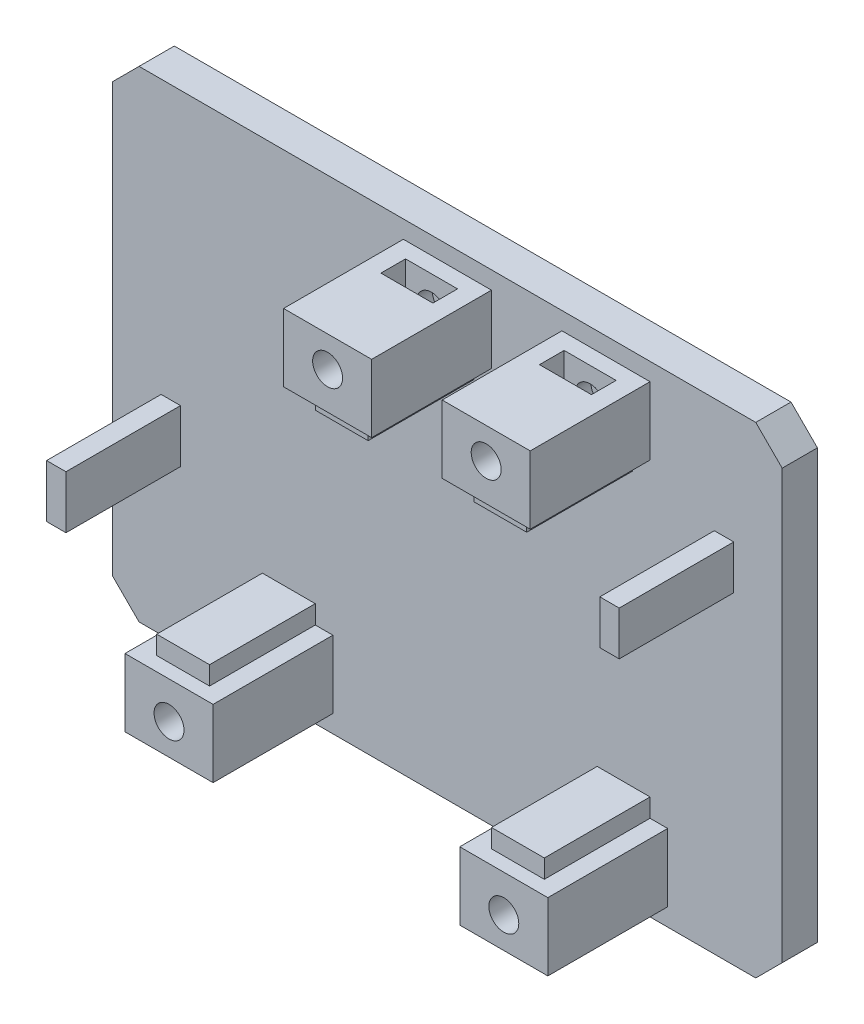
ISO-10303-21;
HEADER;
FILE_DESCRIPTION(('STEP AP214'),'2;1');
FILE_NAME('part.step','',(''),(''),'','','');
FILE_SCHEMA(('AUTOMOTIVE_DESIGN { 1 0 10303 214 1 1 1 1 }'));
ENDSEC;
DATA;
#1=APPLICATION_CONTEXT('core data for automotive mechanical design processes');
#2=APPLICATION_PROTOCOL_DEFINITION('international standard','automotive_design',2000,#1);
#3=PRODUCT_CONTEXT('',#1,'mechanical');
#4=PRODUCT('Part','Part','',(#3));
#5=PRODUCT_RELATED_PRODUCT_CATEGORY('part','',(#4));
#6=PRODUCT_DEFINITION_FORMATION('','',#4);
#7=PRODUCT_DEFINITION_CONTEXT('part definition',#1,'design');
#8=PRODUCT_DEFINITION('design','',#6,#7);
#9=PRODUCT_DEFINITION_SHAPE('','',#8);
#10=(LENGTH_UNIT() NAMED_UNIT(*) SI_UNIT(.MILLI.,.METRE.));
#11=(NAMED_UNIT(*) PLANE_ANGLE_UNIT() SI_UNIT($,.RADIAN.));
#12=(NAMED_UNIT(*) SI_UNIT($,.STERADIAN.) SOLID_ANGLE_UNIT());
#13=UNCERTAINTY_MEASURE_WITH_UNIT(LENGTH_MEASURE(1.E-05),#10,'distance_accuracy_value','');
#14=(GEOMETRIC_REPRESENTATION_CONTEXT(3) GLOBAL_UNCERTAINTY_ASSIGNED_CONTEXT((#13)) GLOBAL_UNIT_ASSIGNED_CONTEXT((#10,
#11,#12)) REPRESENTATION_CONTEXT('',''));
#15=CARTESIAN_POINT('',(0.,0.,0.));
#16=DIRECTION('',(0.,0.,1.));
#17=DIRECTION('',(1.,0.,0.));
#18=AXIS2_PLACEMENT_3D('',#15,#16,#17);
#19=CARTESIAN_POINT('',(0.,0.,4.));
#20=DIRECTION('',(0.,0.,1.));
#21=DIRECTION('',(1.,0.,0.));
#22=AXIS2_PLACEMENT_3D('',#19,#20,#21);
#23=PLANE('',#22);
#24=DIRECTION('',(0.707106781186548,-0.707106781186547,0.));
#25=VECTOR('',#24,1.);
#26=CARTESIAN_POINT('',(-8.,-41.619,4.));
#27=LINE('',#26,#25);
#28=CARTESIAN_POINT('',(-8.,-41.619,4.));
#29=VERTEX_POINT('',#28);
#30=CARTESIAN_POINT('',(-5.,-44.619,4.));
#31=VERTEX_POINT('',#30);
#32=EDGE_CURVE('E885',#29,#31,#27,.T.);
#33=ORIENTED_EDGE('',*,*,#32,.T.);
#34=DIRECTION('',(1.,0.,0.));
#35=VECTOR('',#34,1.);
#36=CARTESIAN_POINT('',(-5.,-44.619,4.));
#37=LINE('',#36,#35);
#38=CARTESIAN_POINT('',(65.,-44.619,4.));
#39=VERTEX_POINT('',#38);
#40=EDGE_CURVE('E888',#31,#39,#37,.T.);
#41=ORIENTED_EDGE('',*,*,#40,.T.);
#42=DIRECTION('',(0.707106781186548,0.707106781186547,0.));
#43=VECTOR('',#42,1.);
#44=CARTESIAN_POINT('',(65.,-44.619,4.));
#45=LINE('',#44,#43);
#46=CARTESIAN_POINT('',(68.,-41.619,4.));
#47=VERTEX_POINT('',#46);
#48=EDGE_CURVE('E891',#39,#47,#45,.T.);
#49=ORIENTED_EDGE('',*,*,#48,.T.);
#50=DIRECTION('',(0.,1.,0.));
#51=VECTOR('',#50,1.);
#52=CARTESIAN_POINT('',(68.,-41.619,4.));
#53=LINE('',#52,#51);
#54=CARTESIAN_POINT('',(68.,7.,4.));
#55=VERTEX_POINT('',#54);
#56=EDGE_CURVE('E893',#47,#55,#53,.T.);
#57=ORIENTED_EDGE('',*,*,#56,.T.);
#58=DIRECTION('',(-0.707106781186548,0.707106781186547,0.));
#59=VECTOR('',#58,1.);
#60=CARTESIAN_POINT('',(68.,7.,4.));
#61=LINE('',#60,#59);
#62=CARTESIAN_POINT('',(65.,10.,4.));
#63=VERTEX_POINT('',#62);
#64=EDGE_CURVE('E895',#55,#63,#61,.T.);
#65=ORIENTED_EDGE('',*,*,#64,.T.);
#66=DIRECTION('',(-1.,0.,0.));
#67=VECTOR('',#66,1.);
#68=CARTESIAN_POINT('',(65.,10.,4.));
#69=LINE('',#68,#67);
#70=CARTESIAN_POINT('',(-5.,10.,4.));
#71=VERTEX_POINT('',#70);
#72=EDGE_CURVE('E897',#63,#71,#69,.T.);
#73=ORIENTED_EDGE('',*,*,#72,.T.);
#74=DIRECTION('',(-0.707106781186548,-0.707106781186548,0.));
#75=VECTOR('',#74,1.);
#76=CARTESIAN_POINT('',(-5.,10.,4.));
#77=LINE('',#76,#75);
#78=CARTESIAN_POINT('',(-8.,7.,4.));
#79=VERTEX_POINT('',#78);
#80=EDGE_CURVE('E899',#71,#79,#77,.T.);
#81=ORIENTED_EDGE('',*,*,#80,.T.);
#82=DIRECTION('',(0.,-1.,0.));
#83=VECTOR('',#82,1.);
#84=CARTESIAN_POINT('',(-8.,7.,4.));
#85=LINE('',#84,#83);
#86=EDGE_CURVE('E901',#79,#29,#85,.T.);
#87=ORIENTED_EDGE('',*,*,#86,.T.);
#88=EDGE_LOOP('',(#33,#41,#49,#57,#65,#73,#81,#87));
#89=FACE_BOUND('',#88,.T.);
#90=DIRECTION('',(1.,0.,0.));
#91=VECTOR('',#90,1.);
#92=CARTESIAN_POINT('',(27.,-1.8,4.));
#93=LINE('',#92,#91);
#94=CARTESIAN_POINT('',(27.,-1.8,4.));
#95=VERTEX_POINT('',#94);
#96=CARTESIAN_POINT('',(33.,-1.8,4.));
#97=VERTEX_POINT('',#96);
#98=EDGE_CURVE('E564',#95,#97,#93,.T.);
#99=ORIENTED_EDGE('',*,*,#98,.F.);
#100=DIRECTION('',(0.,-1.,0.));
#101=VECTOR('',#100,1.);
#102=CARTESIAN_POINT('',(27.,0.6,4.));
#103=LINE('',#102,#101);
#104=CARTESIAN_POINT('',(27.,0.3,4.));
#105=VERTEX_POINT('',#104);
#106=EDGE_CURVE('E534',#105,#95,#103,.T.);
#107=ORIENTED_EDGE('',*,*,#106,.F.);
#108=DIRECTION('',(1.,0.,0.));
#109=VECTOR('',#108,1.);
#110=CARTESIAN_POINT('',(25.,0.3,4.));
#111=LINE('',#110,#109);
#112=CARTESIAN_POINT('',(25.,0.3,4.));
#113=VERTEX_POINT('',#112);
#114=EDGE_CURVE('E868',#113,#105,#111,.T.);
#115=ORIENTED_EDGE('',*,*,#114,.F.);
#116=DIRECTION('',(0.,-1.,0.));
#117=VECTOR('',#116,1.);
#118=CARTESIAN_POINT('',(25.,8.,4.));
#119=LINE('',#118,#117);
#120=CARTESIAN_POINT('',(25.,8.,4.));
#121=VERTEX_POINT('',#120);
#122=EDGE_CURVE('E860',#121,#113,#119,.T.);
#123=ORIENTED_EDGE('',*,*,#122,.F.);
#124=DIRECTION('',(-1.,0.,0.));
#125=VECTOR('',#124,1.);
#126=CARTESIAN_POINT('',(35.,8.,4.));
#127=LINE('',#126,#125);
#128=CARTESIAN_POINT('',(35.,8.,4.));
#129=VERTEX_POINT('',#128);
#130=EDGE_CURVE('E864',#129,#121,#127,.T.);
#131=ORIENTED_EDGE('',*,*,#130,.F.);
#132=DIRECTION('',(0.,1.,0.));
#133=VECTOR('',#132,1.);
#134=CARTESIAN_POINT('',(35.,0.3,4.));
#135=LINE('',#134,#133);
#136=CARTESIAN_POINT('',(35.,0.3,4.));
#137=VERTEX_POINT('',#136);
#138=EDGE_CURVE('E871',#137,#129,#135,.T.);
#139=ORIENTED_EDGE('',*,*,#138,.F.);
#140=CARTESIAN_POINT('',(33.,0.3,4.));
#141=VERTEX_POINT('',#140);
#142=EDGE_CURVE('E867',#141,#137,#111,.T.);
#143=ORIENTED_EDGE('',*,*,#142,.F.);
#144=DIRECTION('',(0.,1.,0.));
#145=VECTOR('',#144,1.);
#146=CARTESIAN_POINT('',(33.,-1.8,4.));
#147=LINE('',#146,#145);
#148=EDGE_CURVE('E558',#97,#141,#147,.T.);
#149=ORIENTED_EDGE('',*,*,#148,.F.);
#150=EDGE_LOOP('',(#99,#107,#115,#123,#131,#139,#143,#149));
#151=FACE_BOUND('',#150,.T.);
#152=DIRECTION('',(-1.,0.,0.));
#153=VECTOR('',#152,1.);
#154=CARTESIAN_POINT('',(45.,-34.919,4.));
#155=LINE('',#154,#153);
#156=CARTESIAN_POINT('',(47.,-34.919,4.));
#157=VERTEX_POINT('',#156);
#158=CARTESIAN_POINT('',(45.,-34.919,4.));
#159=VERTEX_POINT('',#158);
#160=EDGE_CURVE('E638',#157,#159,#155,.T.);
#161=ORIENTED_EDGE('',*,*,#160,.F.);
#162=DIRECTION('',(0.,-1.,0.));
#163=VECTOR('',#162,1.);
#164=CARTESIAN_POINT('',(47.,-32.819,4.));
#165=LINE('',#164,#163);
#166=CARTESIAN_POINT('',(47.,-32.819,4.));
#167=VERTEX_POINT('',#166);
#168=EDGE_CURVE('E512',#167,#157,#165,.T.);
#169=ORIENTED_EDGE('',*,*,#168,.F.);
#170=DIRECTION('',(-1.,0.,0.));
#171=VECTOR('',#170,1.);
#172=CARTESIAN_POINT('',(53.,-32.819,4.));
#173=LINE('',#172,#171);
#174=CARTESIAN_POINT('',(53.,-32.819,4.));
#175=VERTEX_POINT('',#174);
#176=EDGE_CURVE('E507',#175,#167,#173,.T.);
#177=ORIENTED_EDGE('',*,*,#176,.F.);
#178=DIRECTION('',(0.,1.,0.));
#179=VECTOR('',#178,1.);
#180=CARTESIAN_POINT('',(53.,-35.219,4.));
#181=LINE('',#180,#179);
#182=CARTESIAN_POINT('',(53.,-34.919,4.));
#183=VERTEX_POINT('',#182);
#184=EDGE_CURVE('E509',#183,#175,#181,.T.);
#185=ORIENTED_EDGE('',*,*,#184,.F.);
#186=CARTESIAN_POINT('',(55.,-34.919,4.));
#187=VERTEX_POINT('',#186);
#188=EDGE_CURVE('E630',#187,#183,#155,.T.);
#189=ORIENTED_EDGE('',*,*,#188,.F.);
#190=DIRECTION('',(0.,1.,0.));
#191=VECTOR('',#190,1.);
#192=CARTESIAN_POINT('',(55.,-34.919,4.));
#193=LINE('',#192,#191);
#194=CARTESIAN_POINT('',(55.,-42.619,4.));
#195=VERTEX_POINT('',#194);
#196=EDGE_CURVE('E635',#195,#187,#193,.T.);
#197=ORIENTED_EDGE('',*,*,#196,.F.);
#198=DIRECTION('',(1.,0.,0.));
#199=VECTOR('',#198,1.);
#200=CARTESIAN_POINT('',(55.,-42.619,4.));
#201=LINE('',#200,#199);
#202=CARTESIAN_POINT('',(45.,-42.619,4.));
#203=VERTEX_POINT('',#202);
#204=EDGE_CURVE('E633',#203,#195,#201,.T.);
#205=ORIENTED_EDGE('',*,*,#204,.F.);
#206=DIRECTION('',(0.,-1.,0.));
#207=VECTOR('',#206,1.);
#208=CARTESIAN_POINT('',(45.,-42.619,4.));
#209=LINE('',#208,#207);
#210=EDGE_CURVE('E626',#159,#203,#209,.T.);
#211=ORIENTED_EDGE('',*,*,#210,.F.);
#212=EDGE_LOOP('',(#161,#169,#177,#185,#189,#197,#205,#211));
#213=FACE_BOUND('',#212,.T.);
#214=DIRECTION('',(-1.,0.,0.));
#215=VECTOR('',#214,1.);
#216=CARTESIAN_POINT('',(7.,-34.919,4.));
#217=LINE('',#216,#215);
#218=CARTESIAN_POINT('',(9.,-34.919,4.));
#219=VERTEX_POINT('',#218);
#220=CARTESIAN_POINT('',(7.,-34.919,4.));
#221=VERTEX_POINT('',#220);
#222=EDGE_CURVE('E716',#219,#221,#217,.T.);
#223=ORIENTED_EDGE('',*,*,#222,.F.);
#224=DIRECTION('',(0.,-1.,0.));
#225=VECTOR('',#224,1.);
#226=CARTESIAN_POINT('',(9.,-32.819,4.));
#227=LINE('',#226,#225);
#228=CARTESIAN_POINT('',(9.,-32.819,4.));
#229=VERTEX_POINT('',#228);
#230=EDGE_CURVE('E523',#229,#219,#227,.T.);
#231=ORIENTED_EDGE('',*,*,#230,.F.);
#232=DIRECTION('',(-1.,0.,0.));
#233=VECTOR('',#232,1.);
#234=CARTESIAN_POINT('',(15.,-32.819,4.));
#235=LINE('',#234,#233);
#236=CARTESIAN_POINT('',(15.,-32.819,4.));
#237=VERTEX_POINT('',#236);
#238=EDGE_CURVE('E545',#237,#229,#235,.T.);
#239=ORIENTED_EDGE('',*,*,#238,.F.);
#240=DIRECTION('',(0.,1.,0.));
#241=VECTOR('',#240,1.);
#242=CARTESIAN_POINT('',(15.,-35.219,4.));
#243=LINE('',#242,#241);
#244=CARTESIAN_POINT('',(15.,-34.919,4.));
#245=VERTEX_POINT('',#244);
#246=EDGE_CURVE('E547',#245,#237,#243,.T.);
#247=ORIENTED_EDGE('',*,*,#246,.F.);
#248=CARTESIAN_POINT('',(17.,-34.919,4.));
#249=VERTEX_POINT('',#248);
#250=EDGE_CURVE('E708',#249,#245,#217,.T.);
#251=ORIENTED_EDGE('',*,*,#250,.F.);
#252=DIRECTION('',(0.,1.,0.));
#253=VECTOR('',#252,1.);
#254=CARTESIAN_POINT('',(17.,-34.919,4.));
#255=LINE('',#254,#253);
#256=CARTESIAN_POINT('',(17.,-42.619,4.));
#257=VERTEX_POINT('',#256);
#258=EDGE_CURVE('E713',#257,#249,#255,.T.);
#259=ORIENTED_EDGE('',*,*,#258,.F.);
#260=DIRECTION('',(1.,0.,0.));
#261=VECTOR('',#260,1.);
#262=CARTESIAN_POINT('',(17.,-42.619,4.));
#263=LINE('',#262,#261);
#264=CARTESIAN_POINT('',(7.,-42.619,4.));
#265=VERTEX_POINT('',#264);
#266=EDGE_CURVE('E711',#265,#257,#263,.T.);
#267=ORIENTED_EDGE('',*,*,#266,.F.);
#268=DIRECTION('',(0.,-1.,0.));
#269=VECTOR('',#268,1.);
#270=CARTESIAN_POINT('',(7.,-42.619,4.));
#271=LINE('',#270,#269);
#272=EDGE_CURVE('E704',#221,#265,#271,.T.);
#273=ORIENTED_EDGE('',*,*,#272,.F.);
#274=EDGE_LOOP('',(#223,#231,#239,#247,#251,#259,#267,#273));
#275=FACE_BOUND('',#274,.T.);
#276=DIRECTION('',(1.,0.,0.));
#277=VECTOR('',#276,1.);
#278=CARTESIAN_POINT('',(45.,-1.8,4.));
#279=LINE('',#278,#277);
#280=CARTESIAN_POINT('',(45.,-1.8,4.));
#281=VERTEX_POINT('',#280);
#282=CARTESIAN_POINT('',(51.,-1.8,4.));
#283=VERTEX_POINT('',#282);
#284=EDGE_CURVE('E529',#281,#283,#279,.T.);
#285=ORIENTED_EDGE('',*,*,#284,.F.);
#286=DIRECTION('',(0.,-1.,0.));
#287=VECTOR('',#286,1.);
#288=CARTESIAN_POINT('',(45.,0.6,4.));
#289=LINE('',#288,#287);
#290=CARTESIAN_POINT('',(45.,0.3,4.));
#291=VERTEX_POINT('',#290);
#292=EDGE_CURVE('E532',#291,#281,#289,.T.);
#293=ORIENTED_EDGE('',*,*,#292,.F.);
#294=DIRECTION('',(1.,0.,0.));
#295=VECTOR('',#294,1.);
#296=CARTESIAN_POINT('',(43.,0.3,4.));
#297=LINE('',#296,#295);
#298=CARTESIAN_POINT('',(43.,0.3,4.));
#299=VERTEX_POINT('',#298);
#300=EDGE_CURVE('E790',#299,#291,#297,.T.);
#301=ORIENTED_EDGE('',*,*,#300,.F.);
#302=DIRECTION('',(0.,-1.,0.));
#303=VECTOR('',#302,1.);
#304=CARTESIAN_POINT('',(43.,8.,4.));
#305=LINE('',#304,#303);
#306=CARTESIAN_POINT('',(43.,8.,4.));
#307=VERTEX_POINT('',#306);
#308=EDGE_CURVE('E782',#307,#299,#305,.T.);
#309=ORIENTED_EDGE('',*,*,#308,.F.);
#310=DIRECTION('',(-1.,0.,0.));
#311=VECTOR('',#310,1.);
#312=CARTESIAN_POINT('',(53.,8.,4.));
#313=LINE('',#312,#311);
#314=CARTESIAN_POINT('',(53.,8.,4.));
#315=VERTEX_POINT('',#314);
#316=EDGE_CURVE('E786',#315,#307,#313,.T.);
#317=ORIENTED_EDGE('',*,*,#316,.F.);
#318=DIRECTION('',(0.,1.,0.));
#319=VECTOR('',#318,1.);
#320=CARTESIAN_POINT('',(53.,0.3,4.));
#321=LINE('',#320,#319);
#322=CARTESIAN_POINT('',(53.,0.3,4.));
#323=VERTEX_POINT('',#322);
#324=EDGE_CURVE('E793',#323,#315,#321,.T.);
#325=ORIENTED_EDGE('',*,*,#324,.F.);
#326=CARTESIAN_POINT('',(51.,0.3,4.));
#327=VERTEX_POINT('',#326);
#328=EDGE_CURVE('E789',#327,#323,#297,.T.);
#329=ORIENTED_EDGE('',*,*,#328,.F.);
#330=DIRECTION('',(0.,1.,0.));
#331=VECTOR('',#330,1.);
#332=CARTESIAN_POINT('',(51.,-1.8,4.));
#333=LINE('',#332,#331);
#334=EDGE_CURVE('E527',#283,#327,#333,.T.);
#335=ORIENTED_EDGE('',*,*,#334,.F.);
#336=EDGE_LOOP('',(#285,#293,#301,#309,#317,#325,#329,#335));
#337=FACE_BOUND('',#336,.T.);
#338=DIRECTION('',(1.,0.,0.));
#339=VECTOR('',#338,1.);
#340=CARTESIAN_POINT('',(60.3,-8.,4.));
#341=LINE('',#340,#339);
#342=CARTESIAN_POINT('',(60.3,-8.,4.));
#343=VERTEX_POINT('',#342);
#344=CARTESIAN_POINT('',(62.5,-8.,4.));
#345=VERTEX_POINT('',#344);
#346=EDGE_CURVE('E492',#343,#345,#341,.T.);
#347=ORIENTED_EDGE('',*,*,#346,.F.);
#348=DIRECTION('',(0.,-1.,0.));
#349=VECTOR('',#348,1.);
#350=CARTESIAN_POINT('',(60.3,-3.,4.));
#351=LINE('',#350,#349);
#352=CARTESIAN_POINT('',(60.3,-3.,4.));
#353=VERTEX_POINT('',#352);
#354=EDGE_CURVE('E494',#353,#343,#351,.T.);
#355=ORIENTED_EDGE('',*,*,#354,.F.);
#356=DIRECTION('',(-1.,0.,0.));
#357=VECTOR('',#356,1.);
#358=CARTESIAN_POINT('',(62.5,-3.,4.));
#359=LINE('',#358,#357);
#360=CARTESIAN_POINT('',(62.5,-3.,4.));
#361=VERTEX_POINT('',#360);
#362=EDGE_CURVE('E487',#361,#353,#359,.T.);
#363=ORIENTED_EDGE('',*,*,#362,.F.);
#364=DIRECTION('',(0.,1.,0.));
#365=VECTOR('',#364,1.);
#366=CARTESIAN_POINT('',(62.5,-8.,4.));
#367=LINE('',#366,#365);
#368=EDGE_CURVE('E489',#345,#361,#367,.T.);
#369=ORIENTED_EDGE('',*,*,#368,.F.);
#370=EDGE_LOOP('',(#347,#355,#363,#369));
#371=FACE_BOUND('',#370,.T.);
#372=DIRECTION('',(1.,0.,0.));
#373=VECTOR('',#372,1.);
#374=CARTESIAN_POINT('',(-2.5,-27.,4.));
#375=LINE('',#374,#373);
#376=CARTESIAN_POINT('',(-2.5,-27.,4.));
#377=VERTEX_POINT('',#376);
#378=CARTESIAN_POINT('',(-0.3,-27.,4.));
#379=VERTEX_POINT('',#378);
#380=EDGE_CURVE('E1767',#377,#379,#375,.T.);
#381=ORIENTED_EDGE('',*,*,#380,.F.);
#382=DIRECTION('',(0.,-1.,0.));
#383=VECTOR('',#382,1.);
#384=CARTESIAN_POINT('',(-2.5,-21.,4.));
#385=LINE('',#384,#383);
#386=CARTESIAN_POINT('',(-2.5,-21.,4.));
#387=VERTEX_POINT('',#386);
#388=EDGE_CURVE('E467',#387,#377,#385,.T.);
#389=ORIENTED_EDGE('',*,*,#388,.F.);
#390=DIRECTION('',(-1.,0.,0.));
#391=VECTOR('',#390,1.);
#392=CARTESIAN_POINT('',(-0.3,-21.,4.));
#393=LINE('',#392,#391);
#394=CARTESIAN_POINT('',(-0.3,-21.,4.));
#395=VERTEX_POINT('',#394);
#396=EDGE_CURVE('E463',#395,#387,#393,.T.);
#397=ORIENTED_EDGE('',*,*,#396,.F.);
#398=DIRECTION('',(0.,1.,0.));
#399=VECTOR('',#398,1.);
#400=CARTESIAN_POINT('',(-0.3,-27.,4.));
#401=LINE('',#400,#399);
#402=EDGE_CURVE('E1764',#379,#395,#401,.T.);
#403=ORIENTED_EDGE('',*,*,#402,.F.);
#404=EDGE_LOOP('',(#381,#389,#397,#403));
#405=FACE_BOUND('',#404,.T.);
#406=ADVANCED_FACE('F43',(#89,#151,#213,#275,#337,#371,#405),#23,.T.);
#407=CARTESIAN_POINT('',(25.,0.3,5.8));
#408=DIRECTION('',(0.,1.,0.));
#409=DIRECTION('',(0.,0.,1.));
#410=AXIS2_PLACEMENT_3D('',#407,#408,#409);
#411=PLANE('',#410);
#412=DIRECTION('',(0.,0.,-1.));
#413=VECTOR('',#412,1.);
#414=CARTESIAN_POINT('',(27.,0.3,5.8));
#415=LINE('',#414,#413);
#416=CARTESIAN_POINT('',(27.,0.3,16.));
#417=VERTEX_POINT('',#416);
#418=EDGE_CURVE('E11',#417,#105,#415,.T.);
#419=ORIENTED_EDGE('',*,*,#418,.F.);
#420=DIRECTION('',(1.,0.,0.));
#421=VECTOR('',#420,1.);
#422=CARTESIAN_POINT('',(25.,0.3,16.));
#423=LINE('',#422,#421);
#424=CARTESIAN_POINT('',(33.,0.3,16.));
#425=VERTEX_POINT('',#424);
#426=EDGE_CURVE('E978',#417,#425,#423,.T.);
#427=ORIENTED_EDGE('',*,*,#426,.T.);
#428=DIRECTION('',(0.,0.,1.));
#429=VECTOR('',#428,1.);
#430=CARTESIAN_POINT('',(33.,0.3,5.8));
#431=LINE('',#430,#429);
#432=EDGE_CURVE('E51',#141,#425,#431,.T.);
#433=ORIENTED_EDGE('',*,*,#432,.F.);
#434=ORIENTED_EDGE('',*,*,#142,.T.);
#435=DIRECTION('',(0.,0.,-1.));
#436=VECTOR('',#435,1.);
#437=CARTESIAN_POINT('',(35.,0.3,5.8));
#438=LINE('',#437,#436);
#439=CARTESIAN_POINT('',(35.,0.3,17.6));
#440=VERTEX_POINT('',#439);
#441=EDGE_CURVE('E879',#440,#137,#438,.T.);
#442=ORIENTED_EDGE('',*,*,#441,.F.);
#443=DIRECTION('',(1.,0.,0.));
#444=VECTOR('',#443,1.);
#445=CARTESIAN_POINT('',(25.,0.3,17.6));
#446=LINE('',#445,#444);
#447=CARTESIAN_POINT('',(25.,0.3,17.6));
#448=VERTEX_POINT('',#447);
#449=EDGE_CURVE('E816',#448,#440,#446,.T.);
#450=ORIENTED_EDGE('',*,*,#449,.F.);
#451=DIRECTION('',(0.,0.,-1.));
#452=VECTOR('',#451,1.);
#453=CARTESIAN_POINT('',(25.,0.3,5.8));
#454=LINE('',#453,#452);
#455=EDGE_CURVE('E882',#448,#113,#454,.T.);
#456=ORIENTED_EDGE('',*,*,#455,.T.);
#457=ORIENTED_EDGE('',*,*,#114,.T.);
#458=EDGE_LOOP('',(#419,#427,#433,#434,#442,#450,#456,#457));
#459=FACE_BOUND('',#458,.T.);
#460=ADVANCED_FACE('F989',(#459),#411,.F.);
#461=CARTESIAN_POINT('',(43.,0.3,5.8));
#462=DIRECTION('',(0.,1.,0.));
#463=DIRECTION('',(0.,0.,1.));
#464=AXIS2_PLACEMENT_3D('',#461,#462,#463);
#465=PLANE('',#464);
#466=DIRECTION('',(0.,0.,-1.));
#467=VECTOR('',#466,1.);
#468=CARTESIAN_POINT('',(45.,0.3,5.8));
#469=LINE('',#468,#467);
#470=CARTESIAN_POINT('',(45.,0.3,16.));
#471=VERTEX_POINT('',#470);
#472=EDGE_CURVE('E976',#471,#291,#469,.T.);
#473=ORIENTED_EDGE('',*,*,#472,.F.);
#474=DIRECTION('',(1.,0.,0.));
#475=VECTOR('',#474,1.);
#476=CARTESIAN_POINT('',(43.,0.3,16.));
#477=LINE('',#476,#475);
#478=CARTESIAN_POINT('',(51.,0.3,16.));
#479=VERTEX_POINT('',#478);
#480=EDGE_CURVE('E970',#471,#479,#477,.T.);
#481=ORIENTED_EDGE('',*,*,#480,.T.);
#482=DIRECTION('',(0.,0.,1.));
#483=VECTOR('',#482,1.);
#484=CARTESIAN_POINT('',(51.,0.3,5.8));
#485=LINE('',#484,#483);
#486=EDGE_CURVE('E973',#327,#479,#485,.T.);
#487=ORIENTED_EDGE('',*,*,#486,.F.);
#488=ORIENTED_EDGE('',*,*,#328,.T.);
#489=DIRECTION('',(0.,0.,-1.));
#490=VECTOR('',#489,1.);
#491=CARTESIAN_POINT('',(53.,0.3,5.8));
#492=LINE('',#491,#490);
#493=CARTESIAN_POINT('',(53.,0.3,17.6));
#494=VERTEX_POINT('',#493);
#495=EDGE_CURVE('E801',#494,#323,#492,.T.);
#496=ORIENTED_EDGE('',*,*,#495,.F.);
#497=DIRECTION('',(1.,0.,0.));
#498=VECTOR('',#497,1.);
#499=CARTESIAN_POINT('',(43.,0.3,17.6));
#500=LINE('',#499,#498);
#501=CARTESIAN_POINT('',(43.,0.3,17.6));
#502=VERTEX_POINT('',#501);
#503=EDGE_CURVE('E738',#502,#494,#500,.T.);
#504=ORIENTED_EDGE('',*,*,#503,.F.);
#505=DIRECTION('',(0.,0.,-1.));
#506=VECTOR('',#505,1.);
#507=CARTESIAN_POINT('',(43.,0.3,5.8));
#508=LINE('',#507,#506);
#509=EDGE_CURVE('E804',#502,#299,#508,.T.);
#510=ORIENTED_EDGE('',*,*,#509,.T.);
#511=ORIENTED_EDGE('',*,*,#300,.T.);
#512=EDGE_LOOP('',(#473,#481,#487,#488,#496,#504,#510,#511));
#513=FACE_BOUND('',#512,.T.);
#514=ADVANCED_FACE('F1043',(#513),#465,.F.);
#515=CARTESIAN_POINT('',(7.,-34.919,5.8));
#516=DIRECTION('',(0.,-1.,0.));
#517=DIRECTION('',(0.,0.,-1.));
#518=AXIS2_PLACEMENT_3D('',#515,#516,#517);
#519=PLANE('',#518);
#520=DIRECTION('',(0.,0.,1.));
#521=VECTOR('',#520,1.);
#522=CARTESIAN_POINT('',(9.,-34.919,5.8));
#523=LINE('',#522,#521);
#524=CARTESIAN_POINT('',(9.,-34.919,16.));
#525=VERTEX_POINT('',#524);
#526=EDGE_CURVE('E967',#219,#525,#523,.T.);
#527=ORIENTED_EDGE('',*,*,#526,.F.);
#528=ORIENTED_EDGE('',*,*,#222,.T.);
#529=DIRECTION('',(0.,0.,-1.));
#530=VECTOR('',#529,1.);
#531=CARTESIAN_POINT('',(7.,-34.919,5.8));
#532=LINE('',#531,#530);
#533=CARTESIAN_POINT('',(7.,-34.919,17.6));
#534=VERTEX_POINT('',#533);
#535=EDGE_CURVE('E707',#534,#221,#532,.T.);
#536=ORIENTED_EDGE('',*,*,#535,.F.);
#537=DIRECTION('',(-1.,0.,0.));
#538=VECTOR('',#537,1.);
#539=CARTESIAN_POINT('',(7.,-34.919,17.6));
#540=LINE('',#539,#538);
#541=CARTESIAN_POINT('',(17.,-34.919,17.6));
#542=VERTEX_POINT('',#541);
#543=EDGE_CURVE('E666',#542,#534,#540,.T.);
#544=ORIENTED_EDGE('',*,*,#543,.F.);
#545=DIRECTION('',(0.,0.,-1.));
#546=VECTOR('',#545,1.);
#547=CARTESIAN_POINT('',(17.,-34.919,5.8));
#548=LINE('',#547,#546);
#549=EDGE_CURVE('E721',#542,#249,#548,.T.);
#550=ORIENTED_EDGE('',*,*,#549,.T.);
#551=ORIENTED_EDGE('',*,*,#250,.T.);
#552=DIRECTION('',(0.,0.,-1.));
#553=VECTOR('',#552,1.);
#554=CARTESIAN_POINT('',(15.,-34.919,5.8));
#555=LINE('',#554,#553);
#556=CARTESIAN_POINT('',(15.,-34.919,16.));
#557=VERTEX_POINT('',#556);
#558=EDGE_CURVE('E965',#557,#245,#555,.T.);
#559=ORIENTED_EDGE('',*,*,#558,.F.);
#560=DIRECTION('',(-1.,0.,0.));
#561=VECTOR('',#560,1.);
#562=CARTESIAN_POINT('',(7.,-34.919,16.));
#563=LINE('',#562,#561);
#564=EDGE_CURVE('E962',#557,#525,#563,.T.);
#565=ORIENTED_EDGE('',*,*,#564,.T.);
#566=EDGE_LOOP('',(#527,#528,#536,#544,#550,#551,#559,#565));
#567=FACE_BOUND('',#566,.T.);
#568=ADVANCED_FACE('F1111',(#567),#519,.F.);
#569=CARTESIAN_POINT('',(45.,-34.919,5.8));
#570=DIRECTION('',(0.,-1.,0.));
#571=DIRECTION('',(0.,0.,-1.));
#572=AXIS2_PLACEMENT_3D('',#569,#570,#571);
#573=PLANE('',#572);
#574=DIRECTION('',(0.,0.,1.));
#575=VECTOR('',#574,1.);
#576=CARTESIAN_POINT('',(47.,-34.919,5.8));
#577=LINE('',#576,#575);
#578=CARTESIAN_POINT('',(47.,-34.919,16.));
#579=VERTEX_POINT('',#578);
#580=EDGE_CURVE('E959',#157,#579,#577,.T.);
#581=ORIENTED_EDGE('',*,*,#580,.F.);
#582=ORIENTED_EDGE('',*,*,#160,.T.);
#583=DIRECTION('',(0.,0.,-1.));
#584=VECTOR('',#583,1.);
#585=CARTESIAN_POINT('',(45.,-34.919,5.8));
#586=LINE('',#585,#584);
#587=CARTESIAN_POINT('',(45.,-34.919,17.6));
#588=VERTEX_POINT('',#587);
#589=EDGE_CURVE('E629',#588,#159,#586,.T.);
#590=ORIENTED_EDGE('',*,*,#589,.F.);
#591=DIRECTION('',(-1.,0.,0.));
#592=VECTOR('',#591,1.);
#593=CARTESIAN_POINT('',(45.,-34.919,17.6));
#594=LINE('',#593,#592);
#595=CARTESIAN_POINT('',(55.,-34.919,17.6));
#596=VERTEX_POINT('',#595);
#597=EDGE_CURVE('E588',#596,#588,#594,.T.);
#598=ORIENTED_EDGE('',*,*,#597,.F.);
#599=DIRECTION('',(0.,0.,-1.));
#600=VECTOR('',#599,1.);
#601=CARTESIAN_POINT('',(55.,-34.919,5.8));
#602=LINE('',#601,#600);
#603=EDGE_CURVE('E643',#596,#187,#602,.T.);
#604=ORIENTED_EDGE('',*,*,#603,.T.);
#605=ORIENTED_EDGE('',*,*,#188,.T.);
#606=DIRECTION('',(0.,0.,-1.));
#607=VECTOR('',#606,1.);
#608=CARTESIAN_POINT('',(53.,-34.919,5.8));
#609=LINE('',#608,#607);
#610=CARTESIAN_POINT('',(53.,-34.919,16.));
#611=VERTEX_POINT('',#610);
#612=EDGE_CURVE('E957',#611,#183,#609,.T.);
#613=ORIENTED_EDGE('',*,*,#612,.F.);
#614=DIRECTION('',(-1.,0.,0.));
#615=VECTOR('',#614,1.);
#616=CARTESIAN_POINT('',(45.,-34.919,16.));
#617=LINE('',#616,#615);
#618=EDGE_CURVE('E954',#611,#579,#617,.T.);
#619=ORIENTED_EDGE('',*,*,#618,.T.);
#620=EDGE_LOOP('',(#581,#582,#590,#598,#604,#605,#613,#619));
#621=FACE_BOUND('',#620,.T.);
#622=ADVANCED_FACE('F1113',(#621),#573,.F.);
#623=CARTESIAN_POINT('',(0.,0.,5.8));
#624=DIRECTION('',(0.,0.,-1.));
#625=DIRECTION('',(-1.,0.,0.));
#626=AXIS2_PLACEMENT_3D('',#623,#624,#625);
#627=PLANE('',#626);
#628=CARTESIAN_POINT('',(50.,-39.119,5.8));
#629=DIRECTION('',(0.,0.,1.));
#630=DIRECTION('',(1.,0.,0.));
#631=AXIS2_PLACEMENT_3D('',#628,#629,#630);
#632=CIRCLE('',#631,1.7);
#633=CARTESIAN_POINT('',(51.7,-39.119,5.8));
#634=VERTEX_POINT('',#633);
#635=EDGE_CURVE('E623',#634,#634,#632,.T.);
#636=ORIENTED_EDGE('',*,*,#635,.F.);
#637=EDGE_LOOP('',(#636));
#638=FACE_BOUND('',#637,.T.);
#639=DIRECTION('',(0.,-1.,0.));
#640=VECTOR('',#639,1.);
#641=CARTESIAN_POINT('',(52.95,-42.619,5.8));
#642=LINE('',#641,#640);
#643=CARTESIAN_POINT('',(52.95,-35.619,5.8));
#644=VERTEX_POINT('',#643);
#645=CARTESIAN_POINT('',(52.95,-42.619,5.8));
#646=VERTEX_POINT('',#645);
#647=EDGE_CURVE('E598',#644,#646,#642,.T.);
#648=ORIENTED_EDGE('',*,*,#647,.F.);
#649=DIRECTION('',(1.,0.,0.));
#650=VECTOR('',#649,1.);
#651=CARTESIAN_POINT('',(52.95,-35.619,5.8));
#652=LINE('',#651,#650);
#653=CARTESIAN_POINT('',(47.05,-35.619,5.8));
#654=VERTEX_POINT('',#653);
#655=EDGE_CURVE('E607',#654,#644,#652,.T.);
#656=ORIENTED_EDGE('',*,*,#655,.F.);
#657=DIRECTION('',(0.,1.,0.));
#658=VECTOR('',#657,1.);
#659=CARTESIAN_POINT('',(47.05,-35.619,5.8));
#660=LINE('',#659,#658);
#661=CARTESIAN_POINT('',(47.05,-42.619,5.8));
#662=VERTEX_POINT('',#661);
#663=EDGE_CURVE('E591',#662,#654,#660,.T.);
#664=ORIENTED_EDGE('',*,*,#663,.F.);
#665=DIRECTION('',(1.,0.,0.));
#666=VECTOR('',#665,1.);
#667=CARTESIAN_POINT('',(55.,-42.619,5.8));
#668=LINE('',#667,#666);
#669=EDGE_CURVE('E627',#662,#646,#668,.T.);
#670=ORIENTED_EDGE('',*,*,#669,.T.);
#671=EDGE_LOOP('',(#648,#656,#664,#670));
#672=FACE_BOUND('',#671,.T.);
#673=ADVANCED_FACE('F1109',(#638,#672),#627,.F.);
#674=CARTESIAN_POINT('',(0.,0.,5.8));
#675=DIRECTION('',(0.,0.,-1.));
#676=DIRECTION('',(-1.,0.,0.));
#677=AXIS2_PLACEMENT_3D('',#674,#675,#676);
#678=PLANE('',#677);
#679=CARTESIAN_POINT('',(12.,-39.119,5.8));
#680=DIRECTION('',(0.,0.,1.));
#681=DIRECTION('',(1.,0.,0.));
#682=AXIS2_PLACEMENT_3D('',#679,#680,#681);
#683=CIRCLE('',#682,1.7);
#684=CARTESIAN_POINT('',(13.7,-39.119,5.8));
#685=VERTEX_POINT('',#684);
#686=EDGE_CURVE('E701',#685,#685,#683,.T.);
#687=ORIENTED_EDGE('',*,*,#686,.F.);
#688=EDGE_LOOP('',(#687));
#689=FACE_BOUND('',#688,.T.);
#690=DIRECTION('',(0.,-1.,0.));
#691=VECTOR('',#690,1.);
#692=CARTESIAN_POINT('',(14.95,-42.619,5.8));
#693=LINE('',#692,#691);
#694=CARTESIAN_POINT('',(14.95,-35.619,5.8));
#695=VERTEX_POINT('',#694);
#696=CARTESIAN_POINT('',(14.95,-42.619,5.8));
#697=VERTEX_POINT('',#696);
#698=EDGE_CURVE('E676',#695,#697,#693,.T.);
#699=ORIENTED_EDGE('',*,*,#698,.F.);
#700=DIRECTION('',(1.,0.,0.));
#701=VECTOR('',#700,1.);
#702=CARTESIAN_POINT('',(14.95,-35.619,5.8));
#703=LINE('',#702,#701);
#704=CARTESIAN_POINT('',(9.05,-35.619,5.8));
#705=VERTEX_POINT('',#704);
#706=EDGE_CURVE('E685',#705,#695,#703,.T.);
#707=ORIENTED_EDGE('',*,*,#706,.F.);
#708=DIRECTION('',(0.,1.,0.));
#709=VECTOR('',#708,1.);
#710=CARTESIAN_POINT('',(9.05,-35.619,5.8));
#711=LINE('',#710,#709);
#712=CARTESIAN_POINT('',(9.05,-42.619,5.8));
#713=VERTEX_POINT('',#712);
#714=EDGE_CURVE('E669',#713,#705,#711,.T.);
#715=ORIENTED_EDGE('',*,*,#714,.F.);
#716=DIRECTION('',(1.,0.,0.));
#717=VECTOR('',#716,1.);
#718=CARTESIAN_POINT('',(17.,-42.619,5.8));
#719=LINE('',#718,#717);
#720=EDGE_CURVE('E705',#713,#697,#719,.T.);
#721=ORIENTED_EDGE('',*,*,#720,.T.);
#722=EDGE_LOOP('',(#699,#707,#715,#721));
#723=FACE_BOUND('',#722,.T.);
#724=ADVANCED_FACE('F1107',(#689,#723),#678,.F.);
#725=CARTESIAN_POINT('',(-8.,-41.619,4.));
#726=DIRECTION('',(0.707106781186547,0.707106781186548,0.));
#727=DIRECTION('',(-0.707106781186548,0.707106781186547,0.));
#728=AXIS2_PLACEMENT_3D('',#725,#726,#727);
#729=PLANE('',#728);
#730=DIRECTION('',(0.707106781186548,-0.707106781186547,0.));
#731=VECTOR('',#730,1.);
#732=CARTESIAN_POINT('',(-8.,-41.619,0.));
#733=LINE('',#732,#731);
#734=CARTESIAN_POINT('',(-8.,-41.619,0.));
#735=VERTEX_POINT('',#734);
#736=CARTESIAN_POINT('',(-5.,-44.619,0.));
#737=VERTEX_POINT('',#736);
#738=EDGE_CURVE('E884',#735,#737,#733,.T.);
#739=ORIENTED_EDGE('',*,*,#738,.T.);
#740=DIRECTION('',(0.,0.,-1.));
#741=VECTOR('',#740,1.);
#742=CARTESIAN_POINT('',(-5.,-44.619,4.));
#743=LINE('',#742,#741);
#744=EDGE_CURVE('E939',#31,#737,#743,.T.);
#745=ORIENTED_EDGE('',*,*,#744,.F.);
#746=ORIENTED_EDGE('',*,*,#32,.F.);
#747=DIRECTION('',(0.,0.,-1.));
#748=VECTOR('',#747,1.);
#749=CARTESIAN_POINT('',(-8.,-41.619,4.));
#750=LINE('',#749,#748);
#751=EDGE_CURVE('E903',#29,#735,#750,.T.);
#752=ORIENTED_EDGE('',*,*,#751,.T.);
#753=EDGE_LOOP('',(#739,#745,#746,#752));
#754=FACE_BOUND('',#753,.T.);
#755=ADVANCED_FACE('F45',(#754),#729,.F.);
#756=CARTESIAN_POINT('',(-5.,-44.619,4.));
#757=DIRECTION('',(0.,1.,0.));
#758=DIRECTION('',(0.,0.,1.));
#759=AXIS2_PLACEMENT_3D('',#756,#757,#758);
#760=PLANE('',#759);
#761=DIRECTION('',(1.,0.,0.));
#762=VECTOR('',#761,1.);
#763=CARTESIAN_POINT('',(-5.,-44.619,0.));
#764=LINE('',#763,#762);
#765=CARTESIAN_POINT('',(65.,-44.619,0.));
#766=VERTEX_POINT('',#765);
#767=EDGE_CURVE('E906',#737,#766,#764,.T.);
#768=ORIENTED_EDGE('',*,*,#767,.T.);
#769=DIRECTION('',(0.,0.,-1.));
#770=VECTOR('',#769,1.);
#771=CARTESIAN_POINT('',(65.,-44.619,4.));
#772=LINE('',#771,#770);
#773=EDGE_CURVE('E936',#39,#766,#772,.T.);
#774=ORIENTED_EDGE('',*,*,#773,.F.);
#775=ORIENTED_EDGE('',*,*,#40,.F.);
#776=ORIENTED_EDGE('',*,*,#744,.T.);
#777=EDGE_LOOP('',(#768,#774,#775,#776));
#778=FACE_BOUND('',#777,.T.);
#779=ADVANCED_FACE('F2068',(#778),#760,.F.);
#780=CARTESIAN_POINT('',(65.,-44.619,4.));
#781=DIRECTION('',(-0.707106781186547,0.707106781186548,0.));
#782=DIRECTION('',(-0.707106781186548,-0.707106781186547,0.));
#783=AXIS2_PLACEMENT_3D('',#780,#781,#782);
#784=PLANE('',#783);
#785=DIRECTION('',(0.707106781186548,0.707106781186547,0.));
#786=VECTOR('',#785,1.);
#787=CARTESIAN_POINT('',(65.,-44.619,0.));
#788=LINE('',#787,#786);
#789=CARTESIAN_POINT('',(68.,-41.619,0.));
#790=VERTEX_POINT('',#789);
#791=EDGE_CURVE('E908',#766,#790,#788,.T.);
#792=ORIENTED_EDGE('',*,*,#791,.T.);
#793=DIRECTION('',(0.,0.,-1.));
#794=VECTOR('',#793,1.);
#795=CARTESIAN_POINT('',(68.,-41.619,4.));
#796=LINE('',#795,#794);
#797=EDGE_CURVE('E933',#47,#790,#796,.T.);
#798=ORIENTED_EDGE('',*,*,#797,.F.);
#799=ORIENTED_EDGE('',*,*,#48,.F.);
#800=ORIENTED_EDGE('',*,*,#773,.T.);
#801=EDGE_LOOP('',(#792,#798,#799,#800));
#802=FACE_BOUND('',#801,.T.);
#803=ADVANCED_FACE('F2059',(#802),#784,.F.);
#804=CARTESIAN_POINT('',(68.,-41.619,4.));
#805=DIRECTION('',(-1.,0.,0.));
#806=DIRECTION('',(0.,0.,1.));
#807=AXIS2_PLACEMENT_3D('',#804,#805,#806);
#808=PLANE('',#807);
#809=DIRECTION('',(0.,1.,0.));
#810=VECTOR('',#809,1.);
#811=CARTESIAN_POINT('',(68.,-41.619,0.));
#812=LINE('',#811,#810);
#813=CARTESIAN_POINT('',(68.,7.,0.));
#814=VERTEX_POINT('',#813);
#815=EDGE_CURVE('E910',#790,#814,#812,.T.);
#816=ORIENTED_EDGE('',*,*,#815,.T.);
#817=DIRECTION('',(0.,0.,-1.));
#818=VECTOR('',#817,1.);
#819=CARTESIAN_POINT('',(68.,7.,4.));
#820=LINE('',#819,#818);
#821=EDGE_CURVE('E930',#55,#814,#820,.T.);
#822=ORIENTED_EDGE('',*,*,#821,.F.);
#823=ORIENTED_EDGE('',*,*,#56,.F.);
#824=ORIENTED_EDGE('',*,*,#797,.T.);
#825=EDGE_LOOP('',(#816,#822,#823,#824));
#826=FACE_BOUND('',#825,.T.);
#827=ADVANCED_FACE('F2050',(#826),#808,.F.);
#828=CARTESIAN_POINT('',(68.,7.,4.));
#829=DIRECTION('',(-0.707106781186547,-0.707106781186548,0.));
#830=DIRECTION('',(0.707106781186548,-0.707106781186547,0.));
#831=AXIS2_PLACEMENT_3D('',#828,#829,#830);
#832=PLANE('',#831);
#833=DIRECTION('',(-0.707106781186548,0.707106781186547,0.));
#834=VECTOR('',#833,1.);
#835=CARTESIAN_POINT('',(68.,7.,0.));
#836=LINE('',#835,#834);
#837=CARTESIAN_POINT('',(65.,10.,0.));
#838=VERTEX_POINT('',#837);
#839=EDGE_CURVE('E912',#814,#838,#836,.T.);
#840=ORIENTED_EDGE('',*,*,#839,.T.);
#841=DIRECTION('',(0.,0.,-1.));
#842=VECTOR('',#841,1.);
#843=CARTESIAN_POINT('',(65.,10.,4.));
#844=LINE('',#843,#842);
#845=EDGE_CURVE('E927',#63,#838,#844,.T.);
#846=ORIENTED_EDGE('',*,*,#845,.F.);
#847=ORIENTED_EDGE('',*,*,#64,.F.);
#848=ORIENTED_EDGE('',*,*,#821,.T.);
#849=EDGE_LOOP('',(#840,#846,#847,#848));
#850=FACE_BOUND('',#849,.T.);
#851=ADVANCED_FACE('F2041',(#850),#832,.F.);
#852=CARTESIAN_POINT('',(65.,10.,4.));
#853=DIRECTION('',(0.,-1.,0.));
#854=DIRECTION('',(0.,0.,-1.));
#855=AXIS2_PLACEMENT_3D('',#852,#853,#854);
#856=PLANE('',#855);
#857=DIRECTION('',(-1.,0.,0.));
#858=VECTOR('',#857,1.);
#859=CARTESIAN_POINT('',(65.,10.,0.));
#860=LINE('',#859,#858);
#861=CARTESIAN_POINT('',(-5.,10.,0.));
#862=VERTEX_POINT('',#861);
#863=EDGE_CURVE('E914',#838,#862,#860,.T.);
#864=ORIENTED_EDGE('',*,*,#863,.T.);
#865=DIRECTION('',(0.,0.,-1.));
#866=VECTOR('',#865,1.);
#867=CARTESIAN_POINT('',(-5.,10.,4.));
#868=LINE('',#867,#866);
#869=EDGE_CURVE('E924',#71,#862,#868,.T.);
#870=ORIENTED_EDGE('',*,*,#869,.F.);
#871=ORIENTED_EDGE('',*,*,#72,.F.);
#872=ORIENTED_EDGE('',*,*,#845,.T.);
#873=EDGE_LOOP('',(#864,#870,#871,#872));
#874=FACE_BOUND('',#873,.T.);
#875=ADVANCED_FACE('F2032',(#874),#856,.F.);
#876=CARTESIAN_POINT('',(-5.,10.,4.));
#877=DIRECTION('',(0.707106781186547,-0.707106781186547,0.));
#878=DIRECTION('',(0.707106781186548,0.707106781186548,0.));
#879=AXIS2_PLACEMENT_3D('',#876,#877,#878);
#880=PLANE('',#879);
#881=DIRECTION('',(-0.707106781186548,-0.707106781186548,0.));
#882=VECTOR('',#881,1.);
#883=CARTESIAN_POINT('',(-5.,10.,0.));
#884=LINE('',#883,#882);
#885=CARTESIAN_POINT('',(-8.,7.,0.));
#886=VERTEX_POINT('',#885);
#887=EDGE_CURVE('E916',#862,#886,#884,.T.);
#888=ORIENTED_EDGE('',*,*,#887,.T.);
#889=DIRECTION('',(0.,0.,-1.));
#890=VECTOR('',#889,1.);
#891=CARTESIAN_POINT('',(-8.,7.,4.));
#892=LINE('',#891,#890);
#893=EDGE_CURVE('E921',#79,#886,#892,.T.);
#894=ORIENTED_EDGE('',*,*,#893,.F.);
#895=ORIENTED_EDGE('',*,*,#80,.F.);
#896=ORIENTED_EDGE('',*,*,#869,.T.);
#897=EDGE_LOOP('',(#888,#894,#895,#896));
#898=FACE_BOUND('',#897,.T.);
#899=ADVANCED_FACE('F2023',(#898),#880,.F.);
#900=CARTESIAN_POINT('',(-8.,7.,4.));
#901=DIRECTION('',(1.,0.,0.));
#902=DIRECTION('',(0.,0.,-1.));
#903=AXIS2_PLACEMENT_3D('',#900,#901,#902);
#904=PLANE('',#903);
#905=DIRECTION('',(0.,-1.,0.));
#906=VECTOR('',#905,1.);
#907=CARTESIAN_POINT('',(-8.,7.,0.));
#908=LINE('',#907,#906);
#909=EDGE_CURVE('E889',#886,#735,#908,.T.);
#910=ORIENTED_EDGE('',*,*,#909,.T.);
#911=ORIENTED_EDGE('',*,*,#751,.F.);
#912=ORIENTED_EDGE('',*,*,#86,.F.);
#913=ORIENTED_EDGE('',*,*,#893,.T.);
#914=EDGE_LOOP('',(#910,#911,#912,#913));
#915=FACE_BOUND('',#914,.T.);
#916=ADVANCED_FACE('F2015',(#915),#904,.F.);
#917=CARTESIAN_POINT('',(0.,0.,0.));
#918=DIRECTION('',(0.,0.,1.));
#919=DIRECTION('',(1.,0.,0.));
#920=AXIS2_PLACEMENT_3D('',#917,#918,#919);
#921=PLANE('',#920);
#922=ORIENTED_EDGE('',*,*,#738,.F.);
#923=ORIENTED_EDGE('',*,*,#909,.F.);
#924=ORIENTED_EDGE('',*,*,#887,.F.);
#925=ORIENTED_EDGE('',*,*,#863,.F.);
#926=ORIENTED_EDGE('',*,*,#839,.F.);
#927=ORIENTED_EDGE('',*,*,#815,.F.);
#928=ORIENTED_EDGE('',*,*,#791,.F.);
#929=ORIENTED_EDGE('',*,*,#767,.F.);
#930=EDGE_LOOP('',(#922,#923,#924,#925,#926,#927,#928,#929));
#931=FACE_BOUND('',#930,.T.);
#932=ADVANCED_FACE('F1029',(#931),#921,.F.);
#933=CARTESIAN_POINT('',(0.,0.,5.8));
#934=DIRECTION('',(0.,0.,1.));
#935=DIRECTION('',(1.,0.,0.));
#936=AXIS2_PLACEMENT_3D('',#933,#934,#935);
#937=PLANE('',#936);
#938=DIRECTION('',(0.,1.,0.));
#939=VECTOR('',#938,1.);
#940=CARTESIAN_POINT('',(27.05,1.,5.8));
#941=LINE('',#940,#939);
#942=CARTESIAN_POINT('',(27.05,1.,5.8));
#943=VERTEX_POINT('',#942);
#944=CARTESIAN_POINT('',(27.05,8.,5.8));
#945=VERTEX_POINT('',#944);
#946=EDGE_CURVE('E832',#943,#945,#941,.T.);
#947=ORIENTED_EDGE('',*,*,#946,.F.);
#948=DIRECTION('',(-1.,0.,0.));
#949=VECTOR('',#948,1.);
#950=CARTESIAN_POINT('',(32.95,1.,5.8));
#951=LINE('',#950,#949);
#952=CARTESIAN_POINT('',(32.95,1.,5.8));
#953=VERTEX_POINT('',#952);
#954=EDGE_CURVE('E841',#953,#943,#951,.T.);
#955=ORIENTED_EDGE('',*,*,#954,.F.);
#956=DIRECTION('',(0.,-1.,0.));
#957=VECTOR('',#956,1.);
#958=CARTESIAN_POINT('',(32.95,8.,5.8));
#959=LINE('',#958,#957);
#960=CARTESIAN_POINT('',(32.95,8.,5.8));
#961=VERTEX_POINT('',#960);
#962=EDGE_CURVE('E825',#961,#953,#959,.T.);
#963=ORIENTED_EDGE('',*,*,#962,.F.);
#964=DIRECTION('',(-1.,0.,0.));
#965=VECTOR('',#964,1.);
#966=CARTESIAN_POINT('',(35.,8.,5.8));
#967=LINE('',#966,#965);
#968=EDGE_CURVE('E861',#961,#945,#967,.T.);
#969=ORIENTED_EDGE('',*,*,#968,.T.);
#970=EDGE_LOOP('',(#947,#955,#963,#969));
#971=FACE_BOUND('',#970,.T.);
#972=CARTESIAN_POINT('',(30.,4.5,5.8));
#973=DIRECTION('',(0.,0.,1.));
#974=DIRECTION('',(1.,0.,0.));
#975=AXIS2_PLACEMENT_3D('',#972,#973,#974);
#976=CIRCLE('',#975,1.7);
#977=CARTESIAN_POINT('',(31.7,4.5,5.8));
#978=VERTEX_POINT('',#977);
#979=EDGE_CURVE('E857',#978,#978,#976,.T.);
#980=ORIENTED_EDGE('',*,*,#979,.F.);
#981=EDGE_LOOP('',(#980));
#982=FACE_BOUND('',#981,.T.);
#983=ADVANCED_FACE('F1022',(#971,#982),#937,.T.);
#984=CARTESIAN_POINT('',(25.,8.,5.8));
#985=DIRECTION('',(1.,0.,0.));
#986=DIRECTION('',(0.,0.,-1.));
#987=AXIS2_PLACEMENT_3D('',#984,#985,#986);
#988=PLANE('',#987);
#989=ORIENTED_EDGE('',*,*,#122,.T.);
#990=ORIENTED_EDGE('',*,*,#455,.F.);
#991=DIRECTION('',(0.,-1.,0.));
#992=VECTOR('',#991,1.);
#993=CARTESIAN_POINT('',(25.,8.,17.6));
#994=LINE('',#993,#992);
#995=CARTESIAN_POINT('',(25.,8.,17.6));
#996=VERTEX_POINT('',#995);
#997=EDGE_CURVE('E813',#996,#448,#994,.T.);
#998=ORIENTED_EDGE('',*,*,#997,.F.);
#999=DIRECTION('',(0.,0.,-1.));
#1000=VECTOR('',#999,1.);
#1001=CARTESIAN_POINT('',(25.,8.,5.8));
#1002=LINE('',#1001,#1000);
#1003=EDGE_CURVE('E863',#996,#121,#1002,.T.);
#1004=ORIENTED_EDGE('',*,*,#1003,.T.);
#1005=EDGE_LOOP('',(#989,#990,#998,#1004));
#1006=FACE_BOUND('',#1005,.T.);
#1007=ADVANCED_FACE('F1020',(#1006),#988,.F.);
#1008=CARTESIAN_POINT('',(35.,0.3,5.8));
#1009=DIRECTION('',(-1.,0.,0.));
#1010=DIRECTION('',(0.,0.,1.));
#1011=AXIS2_PLACEMENT_3D('',#1008,#1009,#1010);
#1012=PLANE('',#1011);
#1013=ORIENTED_EDGE('',*,*,#138,.T.);
#1014=DIRECTION('',(0.,0.,-1.));
#1015=VECTOR('',#1014,1.);
#1016=CARTESIAN_POINT('',(35.,8.,5.8));
#1017=LINE('',#1016,#1015);
#1018=CARTESIAN_POINT('',(35.,8.,17.6));
#1019=VERTEX_POINT('',#1018);
#1020=EDGE_CURVE('E877',#1019,#129,#1017,.T.);
#1021=ORIENTED_EDGE('',*,*,#1020,.F.);
#1022=DIRECTION('',(0.,1.,0.));
#1023=VECTOR('',#1022,1.);
#1024=CARTESIAN_POINT('',(35.,0.3,17.6));
#1025=LINE('',#1024,#1023);
#1026=EDGE_CURVE('E819',#440,#1019,#1025,.T.);
#1027=ORIENTED_EDGE('',*,*,#1026,.F.);
#1028=ORIENTED_EDGE('',*,*,#441,.T.);
#1029=EDGE_LOOP('',(#1013,#1021,#1027,#1028));
#1030=FACE_BOUND('',#1029,.T.);
#1031=ADVANCED_FACE('F1010',(#1030),#1012,.F.);
#1032=CARTESIAN_POINT('',(35.,8.,5.8));
#1033=DIRECTION('',(0.,-1.,0.));
#1034=DIRECTION('',(0.,0.,-1.));
#1035=AXIS2_PLACEMENT_3D('',#1032,#1033,#1034);
#1036=PLANE('',#1035);
#1037=DIRECTION('',(0.,0.,-1.));
#1038=VECTOR('',#1037,1.);
#1039=CARTESIAN_POINT('',(32.95,8.,8.6));
#1040=LINE('',#1039,#1038);
#1041=CARTESIAN_POINT('',(32.95,8.,8.6));
#1042=VERTEX_POINT('',#1041);
#1043=EDGE_CURVE('E854',#1042,#961,#1040,.T.);
#1044=ORIENTED_EDGE('',*,*,#1043,.F.);
#1045=DIRECTION('',(-1.,0.,0.));
#1046=VECTOR('',#1045,1.);
#1047=CARTESIAN_POINT('',(35.,8.,8.6));
#1048=LINE('',#1047,#1046);
#1049=CARTESIAN_POINT('',(27.05,8.,8.6));
#1050=VERTEX_POINT('',#1049);
#1051=EDGE_CURVE('E810',#1042,#1050,#1048,.T.);
#1052=ORIENTED_EDGE('',*,*,#1051,.T.);
#1053=DIRECTION('',(0.,0.,-1.));
#1054=VECTOR('',#1053,1.);
#1055=CARTESIAN_POINT('',(27.05,8.,8.6));
#1056=LINE('',#1055,#1054);
#1057=EDGE_CURVE('E838',#1050,#945,#1056,.T.);
#1058=ORIENTED_EDGE('',*,*,#1057,.T.);
#1059=ORIENTED_EDGE('',*,*,#968,.F.);
#1060=EDGE_LOOP('',(#1044,#1052,#1058,#1059));
#1061=FACE_BOUND('',#1060,.T.);
#1062=ORIENTED_EDGE('',*,*,#130,.T.);
#1063=ORIENTED_EDGE('',*,*,#1003,.F.);
#1064=DIRECTION('',(-1.,0.,0.));
#1065=VECTOR('',#1064,1.);
#1066=CARTESIAN_POINT('',(35.,8.,17.6));
#1067=LINE('',#1066,#1065);
#1068=EDGE_CURVE('E822',#1019,#996,#1067,.T.);
#1069=ORIENTED_EDGE('',*,*,#1068,.F.);
#1070=ORIENTED_EDGE('',*,*,#1020,.T.);
#1071=EDGE_LOOP('',(#1062,#1063,#1069,#1070));
#1072=FACE_BOUND('',#1071,.T.);
#1073=ADVANCED_FACE('F1017',(#1061,#1072),#1036,.F.);
#1074=CARTESIAN_POINT('',(30.,4.5,5.8));
#1075=DIRECTION('',(0.,0.,-1.));
#1076=DIRECTION('',(-1.,0.,0.));
#1077=AXIS2_PLACEMENT_3D('',#1074,#1075,#1076);
#1078=CYLINDRICAL_SURFACE('',#1077,1.7);
#1079=ORIENTED_EDGE('',*,*,#979,.T.);
#1080=EDGE_LOOP('',(#1079));
#1081=FACE_BOUND('',#1080,.T.);
#1082=CARTESIAN_POINT('',(30.,4.5,4.));
#1083=DIRECTION('',(0.,0.,1.));
#1084=DIRECTION('',(1.,0.,0.));
#1085=AXIS2_PLACEMENT_3D('',#1082,#1083,#1084);
#1086=CIRCLE('',#1085,1.7);
#1087=CARTESIAN_POINT('',(31.7,4.5,4.));
#1088=VERTEX_POINT('',#1087);
#1089=EDGE_CURVE('E942',#1088,#1088,#1086,.F.);
#1090=ORIENTED_EDGE('',*,*,#1089,.T.);
#1091=EDGE_LOOP('',(#1090));
#1092=FACE_BOUND('',#1091,.T.);
#1093=ADVANCED_FACE('F1052',(#1081,#1092),#1078,.F.);
#1094=ORIENTED_EDGE('',*,*,#1089,.F.);
#1095=EDGE_LOOP('',(#1094));
#1096=FACE_BOUND('',#1095,.T.);
#1097=ADVANCED_FACE('F1037',(#1096),#23,.T.);
#1098=CARTESIAN_POINT('',(32.95,8.,8.6));
#1099=DIRECTION('',(1.,0.,0.));
#1100=DIRECTION('',(0.,0.,-1.));
#1101=AXIS2_PLACEMENT_3D('',#1098,#1099,#1100);
#1102=PLANE('',#1101);
#1103=ORIENTED_EDGE('',*,*,#962,.T.);
#1104=DIRECTION('',(0.,0.,-1.));
#1105=VECTOR('',#1104,1.);
#1106=CARTESIAN_POINT('',(32.95,1.,8.6));
#1107=LINE('',#1106,#1105);
#1108=CARTESIAN_POINT('',(32.95,1.,8.6));
#1109=VERTEX_POINT('',#1108);
#1110=EDGE_CURVE('E851',#1109,#953,#1107,.T.);
#1111=ORIENTED_EDGE('',*,*,#1110,.F.);
#1112=DIRECTION('',(0.,-1.,0.));
#1113=VECTOR('',#1112,1.);
#1114=CARTESIAN_POINT('',(32.95,8.,8.6));
#1115=LINE('',#1114,#1113);
#1116=EDGE_CURVE('E828',#1042,#1109,#1115,.T.);
#1117=ORIENTED_EDGE('',*,*,#1116,.F.);
#1118=ORIENTED_EDGE('',*,*,#1043,.T.);
#1119=EDGE_LOOP('',(#1103,#1111,#1117,#1118));
#1120=FACE_BOUND('',#1119,.T.);
#1121=ADVANCED_FACE('F1051',(#1120),#1102,.F.);
#1122=CARTESIAN_POINT('',(32.95,1.,8.6));
#1123=DIRECTION('',(0.,-1.,0.));
#1124=DIRECTION('',(0.,0.,-1.));
#1125=AXIS2_PLACEMENT_3D('',#1122,#1123,#1124);
#1126=PLANE('',#1125);
#1127=ORIENTED_EDGE('',*,*,#954,.T.);
#1128=DIRECTION('',(0.,0.,-1.));
#1129=VECTOR('',#1128,1.);
#1130=CARTESIAN_POINT('',(27.05,1.,8.6));
#1131=LINE('',#1130,#1129);
#1132=CARTESIAN_POINT('',(27.05,1.,8.6));
#1133=VERTEX_POINT('',#1132);
#1134=EDGE_CURVE('E848',#1133,#943,#1131,.T.);
#1135=ORIENTED_EDGE('',*,*,#1134,.F.);
#1136=DIRECTION('',(-1.,0.,0.));
#1137=VECTOR('',#1136,1.);
#1138=CARTESIAN_POINT('',(32.95,1.,8.6));
#1139=LINE('',#1138,#1137);
#1140=EDGE_CURVE('E831',#1109,#1133,#1139,.T.);
#1141=ORIENTED_EDGE('',*,*,#1140,.F.);
#1142=ORIENTED_EDGE('',*,*,#1110,.T.);
#1143=EDGE_LOOP('',(#1127,#1135,#1141,#1142));
#1144=FACE_BOUND('',#1143,.T.);
#1145=ADVANCED_FACE('F1059',(#1144),#1126,.F.);
#1146=CARTESIAN_POINT('',(27.05,1.,8.6));
#1147=DIRECTION('',(-1.,0.,0.));
#1148=DIRECTION('',(0.,0.,1.));
#1149=AXIS2_PLACEMENT_3D('',#1146,#1147,#1148);
#1150=PLANE('',#1149);
#1151=ORIENTED_EDGE('',*,*,#946,.T.);
#1152=ORIENTED_EDGE('',*,*,#1057,.F.);
#1153=DIRECTION('',(0.,1.,0.));
#1154=VECTOR('',#1153,1.);
#1155=CARTESIAN_POINT('',(27.05,1.,8.6));
#1156=LINE('',#1155,#1154);
#1157=EDGE_CURVE('E835',#1133,#1050,#1156,.T.);
#1158=ORIENTED_EDGE('',*,*,#1157,.F.);
#1159=ORIENTED_EDGE('',*,*,#1134,.T.);
#1160=EDGE_LOOP('',(#1151,#1152,#1158,#1159));
#1161=FACE_BOUND('',#1160,.T.);
#1162=ADVANCED_FACE('F1167',(#1161),#1150,.F.);
#1163=CARTESIAN_POINT('',(0.,0.,8.6));
#1164=DIRECTION('',(0.,0.,1.));
#1165=DIRECTION('',(1.,0.,0.));
#1166=AXIS2_PLACEMENT_3D('',#1163,#1164,#1165);
#1167=PLANE('',#1166);
#1168=CARTESIAN_POINT('',(30.,4.5,8.6));
#1169=DIRECTION('',(0.,0.,1.));
#1170=DIRECTION('',(1.,0.,0.));
#1171=AXIS2_PLACEMENT_3D('',#1168,#1169,#1170);
#1172=CIRCLE('',#1171,1.7);
#1173=CARTESIAN_POINT('',(31.7,4.5,8.6));
#1174=VERTEX_POINT('',#1173);
#1175=EDGE_CURVE('E806',#1174,#1174,#1172,.T.);
#1176=ORIENTED_EDGE('',*,*,#1175,.T.);
#1177=EDGE_LOOP('',(#1176));
#1178=FACE_BOUND('',#1177,.T.);
#1179=ORIENTED_EDGE('',*,*,#1051,.F.);
#1180=ORIENTED_EDGE('',*,*,#1116,.T.);
#1181=ORIENTED_EDGE('',*,*,#1140,.T.);
#1182=ORIENTED_EDGE('',*,*,#1157,.T.);
#1183=EDGE_LOOP('',(#1179,#1180,#1181,#1182));
#1184=FACE_BOUND('',#1183,.T.);
#1185=ADVANCED_FACE('F1164',(#1178,#1184),#1167,.F.);
#1186=CARTESIAN_POINT('',(0.,0.,17.6));
#1187=DIRECTION('',(0.,0.,1.));
#1188=DIRECTION('',(1.,0.,0.));
#1189=AXIS2_PLACEMENT_3D('',#1186,#1187,#1188);
#1190=PLANE('',#1189);
#1191=ORIENTED_EDGE('',*,*,#997,.T.);
#1192=ORIENTED_EDGE('',*,*,#449,.T.);
#1193=ORIENTED_EDGE('',*,*,#1026,.T.);
#1194=ORIENTED_EDGE('',*,*,#1068,.T.);
#1195=EDGE_LOOP('',(#1191,#1192,#1193,#1194));
#1196=FACE_BOUND('',#1195,.T.);
#1197=CARTESIAN_POINT('',(30.,4.5,17.6));
#1198=DIRECTION('',(0.,0.,1.));
#1199=DIRECTION('',(1.,0.,0.));
#1200=AXIS2_PLACEMENT_3D('',#1197,#1198,#1199);
#1201=CIRCLE('',#1200,1.7);
#1202=CARTESIAN_POINT('',(31.7,4.5,17.6));
#1203=VERTEX_POINT('',#1202);
#1204=EDGE_CURVE('E807',#1203,#1203,#1201,.T.);
#1205=ORIENTED_EDGE('',*,*,#1204,.F.);
#1206=EDGE_LOOP('',(#1205));
#1207=FACE_BOUND('',#1206,.T.);
#1208=ADVANCED_FACE('F1013',(#1196,#1207),#1190,.T.);
#1209=CARTESIAN_POINT('',(30.,4.5,17.6));
#1210=DIRECTION('',(0.,0.,-1.));
#1211=DIRECTION('',(-1.,0.,0.));
#1212=AXIS2_PLACEMENT_3D('',#1209,#1210,#1211);
#1213=CYLINDRICAL_SURFACE('',#1212,1.7);
#1214=ORIENTED_EDGE('',*,*,#1204,.T.);
#1215=EDGE_LOOP('',(#1214));
#1216=FACE_BOUND('',#1215,.T.);
#1217=ORIENTED_EDGE('',*,*,#1175,.F.);
#1218=EDGE_LOOP('',(#1217));
#1219=FACE_BOUND('',#1218,.T.);
#1220=ADVANCED_FACE('F1144',(#1216,#1219),#1213,.F.);
#1221=CARTESIAN_POINT('',(0.,0.,5.8));
#1222=DIRECTION('',(0.,0.,1.));
#1223=DIRECTION('',(1.,0.,0.));
#1224=AXIS2_PLACEMENT_3D('',#1221,#1222,#1223);
#1225=PLANE('',#1224);
#1226=DIRECTION('',(0.,1.,0.));
#1227=VECTOR('',#1226,1.);
#1228=CARTESIAN_POINT('',(45.05,1.,5.8));
#1229=LINE('',#1228,#1227);
#1230=CARTESIAN_POINT('',(45.05,1.,5.8));
#1231=VERTEX_POINT('',#1230);
#1232=CARTESIAN_POINT('',(45.05,8.,5.8));
#1233=VERTEX_POINT('',#1232);
#1234=EDGE_CURVE('E754',#1231,#1233,#1229,.T.);
#1235=ORIENTED_EDGE('',*,*,#1234,.F.);
#1236=DIRECTION('',(-1.,0.,0.));
#1237=VECTOR('',#1236,1.);
#1238=CARTESIAN_POINT('',(50.95,1.,5.8));
#1239=LINE('',#1238,#1237);
#1240=CARTESIAN_POINT('',(50.95,1.,5.8));
#1241=VERTEX_POINT('',#1240);
#1242=EDGE_CURVE('E763',#1241,#1231,#1239,.T.);
#1243=ORIENTED_EDGE('',*,*,#1242,.F.);
#1244=DIRECTION('',(0.,-1.,0.));
#1245=VECTOR('',#1244,1.);
#1246=CARTESIAN_POINT('',(50.95,8.,5.8));
#1247=LINE('',#1246,#1245);
#1248=CARTESIAN_POINT('',(50.95,8.,5.8));
#1249=VERTEX_POINT('',#1248);
#1250=EDGE_CURVE('E747',#1249,#1241,#1247,.T.);
#1251=ORIENTED_EDGE('',*,*,#1250,.F.);
#1252=DIRECTION('',(-1.,0.,0.));
#1253=VECTOR('',#1252,1.);
#1254=CARTESIAN_POINT('',(53.,8.,5.8));
#1255=LINE('',#1254,#1253);
#1256=EDGE_CURVE('E783',#1249,#1233,#1255,.T.);
#1257=ORIENTED_EDGE('',*,*,#1256,.T.);
#1258=EDGE_LOOP('',(#1235,#1243,#1251,#1257));
#1259=FACE_BOUND('',#1258,.T.);
#1260=CARTESIAN_POINT('',(48.,4.5,5.8));
#1261=DIRECTION('',(0.,0.,1.));
#1262=DIRECTION('',(1.,0.,0.));
#1263=AXIS2_PLACEMENT_3D('',#1260,#1261,#1262);
#1264=CIRCLE('',#1263,1.7);
#1265=CARTESIAN_POINT('',(49.7,4.5,5.8));
#1266=VERTEX_POINT('',#1265);
#1267=EDGE_CURVE('E779',#1266,#1266,#1264,.T.);
#1268=ORIENTED_EDGE('',*,*,#1267,.F.);
#1269=EDGE_LOOP('',(#1268));
#1270=FACE_BOUND('',#1269,.T.);
#1271=ADVANCED_FACE('F1141',(#1259,#1270),#1225,.T.);
#1272=CARTESIAN_POINT('',(43.,8.,5.8));
#1273=DIRECTION('',(1.,0.,0.));
#1274=DIRECTION('',(0.,0.,-1.));
#1275=AXIS2_PLACEMENT_3D('',#1272,#1273,#1274);
#1276=PLANE('',#1275);
#1277=ORIENTED_EDGE('',*,*,#308,.T.);
#1278=ORIENTED_EDGE('',*,*,#509,.F.);
#1279=DIRECTION('',(0.,-1.,0.));
#1280=VECTOR('',#1279,1.);
#1281=CARTESIAN_POINT('',(43.,8.,17.6));
#1282=LINE('',#1281,#1280);
#1283=CARTESIAN_POINT('',(43.,8.,17.6));
#1284=VERTEX_POINT('',#1283);
#1285=EDGE_CURVE('E735',#1284,#502,#1282,.T.);
#1286=ORIENTED_EDGE('',*,*,#1285,.F.);
#1287=DIRECTION('',(0.,0.,-1.));
#1288=VECTOR('',#1287,1.);
#1289=CARTESIAN_POINT('',(43.,8.,5.8));
#1290=LINE('',#1289,#1288);
#1291=EDGE_CURVE('E785',#1284,#307,#1290,.T.);
#1292=ORIENTED_EDGE('',*,*,#1291,.T.);
#1293=EDGE_LOOP('',(#1277,#1278,#1286,#1292));
#1294=FACE_BOUND('',#1293,.T.);
#1295=ADVANCED_FACE('F1143',(#1294),#1276,.F.);
#1296=CARTESIAN_POINT('',(53.,0.3,5.8));
#1297=DIRECTION('',(-1.,0.,0.));
#1298=DIRECTION('',(0.,0.,1.));
#1299=AXIS2_PLACEMENT_3D('',#1296,#1297,#1298);
#1300=PLANE('',#1299);
#1301=ORIENTED_EDGE('',*,*,#324,.T.);
#1302=DIRECTION('',(0.,0.,-1.));
#1303=VECTOR('',#1302,1.);
#1304=CARTESIAN_POINT('',(53.,8.,5.8));
#1305=LINE('',#1304,#1303);
#1306=CARTESIAN_POINT('',(53.,8.,17.6));
#1307=VERTEX_POINT('',#1306);
#1308=EDGE_CURVE('E799',#1307,#315,#1305,.T.);
#1309=ORIENTED_EDGE('',*,*,#1308,.F.);
#1310=DIRECTION('',(0.,1.,0.));
#1311=VECTOR('',#1310,1.);
#1312=CARTESIAN_POINT('',(53.,0.3,17.6));
#1313=LINE('',#1312,#1311);
#1314=EDGE_CURVE('E741',#494,#1307,#1313,.T.);
#1315=ORIENTED_EDGE('',*,*,#1314,.F.);
#1316=ORIENTED_EDGE('',*,*,#495,.T.);
#1317=EDGE_LOOP('',(#1301,#1309,#1315,#1316));
#1318=FACE_BOUND('',#1317,.T.);
#1319=ADVANCED_FACE('F1148',(#1318),#1300,.F.);
#1320=CARTESIAN_POINT('',(53.,8.,5.8));
#1321=DIRECTION('',(0.,-1.,0.));
#1322=DIRECTION('',(0.,0.,-1.));
#1323=AXIS2_PLACEMENT_3D('',#1320,#1321,#1322);
#1324=PLANE('',#1323);
#1325=DIRECTION('',(0.,0.,-1.));
#1326=VECTOR('',#1325,1.);
#1327=CARTESIAN_POINT('',(50.95,8.,8.6));
#1328=LINE('',#1327,#1326);
#1329=CARTESIAN_POINT('',(50.95,8.,8.6));
#1330=VERTEX_POINT('',#1329);
#1331=EDGE_CURVE('E776',#1330,#1249,#1328,.T.);
#1332=ORIENTED_EDGE('',*,*,#1331,.F.);
#1333=DIRECTION('',(-1.,0.,0.));
#1334=VECTOR('',#1333,1.);
#1335=CARTESIAN_POINT('',(53.,8.,8.6));
#1336=LINE('',#1335,#1334);
#1337=CARTESIAN_POINT('',(45.05,8.,8.6));
#1338=VERTEX_POINT('',#1337);
#1339=EDGE_CURVE('E732',#1330,#1338,#1336,.T.);
#1340=ORIENTED_EDGE('',*,*,#1339,.T.);
#1341=DIRECTION('',(0.,0.,-1.));
#1342=VECTOR('',#1341,1.);
#1343=CARTESIAN_POINT('',(45.05,8.,8.6));
#1344=LINE('',#1343,#1342);
#1345=EDGE_CURVE('E760',#1338,#1233,#1344,.T.);
#1346=ORIENTED_EDGE('',*,*,#1345,.T.);
#1347=ORIENTED_EDGE('',*,*,#1256,.F.);
#1348=EDGE_LOOP('',(#1332,#1340,#1346,#1347));
#1349=FACE_BOUND('',#1348,.T.);
#1350=ORIENTED_EDGE('',*,*,#316,.T.);
#1351=ORIENTED_EDGE('',*,*,#1291,.F.);
#1352=DIRECTION('',(-1.,0.,0.));
#1353=VECTOR('',#1352,1.);
#1354=CARTESIAN_POINT('',(53.,8.,17.6));
#1355=LINE('',#1354,#1353);
#1356=EDGE_CURVE('E744',#1307,#1284,#1355,.T.);
#1357=ORIENTED_EDGE('',*,*,#1356,.F.);
#1358=ORIENTED_EDGE('',*,*,#1308,.T.);
#1359=EDGE_LOOP('',(#1350,#1351,#1357,#1358));
#1360=FACE_BOUND('',#1359,.T.);
#1361=ADVANCED_FACE('F1077',(#1349,#1360),#1324,.F.);
#1362=CARTESIAN_POINT('',(48.,4.5,5.8));
#1363=DIRECTION('',(0.,0.,-1.));
#1364=DIRECTION('',(-1.,0.,0.));
#1365=AXIS2_PLACEMENT_3D('',#1362,#1363,#1364);
#1366=CYLINDRICAL_SURFACE('',#1365,1.7);
#1367=ORIENTED_EDGE('',*,*,#1267,.T.);
#1368=EDGE_LOOP('',(#1367));
#1369=FACE_BOUND('',#1368,.T.);
#1370=CARTESIAN_POINT('',(48.,4.5,4.));
#1371=DIRECTION('',(0.,0.,1.));
#1372=DIRECTION('',(1.,0.,0.));
#1373=AXIS2_PLACEMENT_3D('',#1370,#1371,#1372);
#1374=CIRCLE('',#1373,1.7);
#1375=CARTESIAN_POINT('',(49.7,4.5,4.));
#1376=VERTEX_POINT('',#1375);
#1377=EDGE_CURVE('E945',#1376,#1376,#1374,.F.);
#1378=ORIENTED_EDGE('',*,*,#1377,.T.);
#1379=EDGE_LOOP('',(#1378));
#1380=FACE_BOUND('',#1379,.T.);
#1381=ADVANCED_FACE('F1067',(#1369,#1380),#1366,.F.);
#1382=ORIENTED_EDGE('',*,*,#1377,.F.);
#1383=EDGE_LOOP('',(#1382));
#1384=FACE_BOUND('',#1383,.T.);
#1385=ADVANCED_FACE('F1054',(#1384),#23,.T.);
#1386=CARTESIAN_POINT('',(50.95,8.,8.6));
#1387=DIRECTION('',(1.,0.,0.));
#1388=DIRECTION('',(0.,0.,-1.));
#1389=AXIS2_PLACEMENT_3D('',#1386,#1387,#1388);
#1390=PLANE('',#1389);
#1391=ORIENTED_EDGE('',*,*,#1250,.T.);
#1392=DIRECTION('',(0.,0.,-1.));
#1393=VECTOR('',#1392,1.);
#1394=CARTESIAN_POINT('',(50.95,1.,8.6));
#1395=LINE('',#1394,#1393);
#1396=CARTESIAN_POINT('',(50.95,1.,8.6));
#1397=VERTEX_POINT('',#1396);
#1398=EDGE_CURVE('E773',#1397,#1241,#1395,.T.);
#1399=ORIENTED_EDGE('',*,*,#1398,.F.);
#1400=DIRECTION('',(0.,-1.,0.));
#1401=VECTOR('',#1400,1.);
#1402=CARTESIAN_POINT('',(50.95,8.,8.6));
#1403=LINE('',#1402,#1401);
#1404=EDGE_CURVE('E750',#1330,#1397,#1403,.T.);
#1405=ORIENTED_EDGE('',*,*,#1404,.F.);
#1406=ORIENTED_EDGE('',*,*,#1331,.T.);
#1407=EDGE_LOOP('',(#1391,#1399,#1405,#1406));
#1408=FACE_BOUND('',#1407,.T.);
#1409=ADVANCED_FACE('F1066',(#1408),#1390,.F.);
#1410=CARTESIAN_POINT('',(50.95,1.,8.6));
#1411=DIRECTION('',(0.,-1.,0.));
#1412=DIRECTION('',(0.,0.,-1.));
#1413=AXIS2_PLACEMENT_3D('',#1410,#1411,#1412);
#1414=PLANE('',#1413);
#1415=ORIENTED_EDGE('',*,*,#1242,.T.);
#1416=DIRECTION('',(0.,0.,-1.));
#1417=VECTOR('',#1416,1.);
#1418=CARTESIAN_POINT('',(45.05,1.,8.6));
#1419=LINE('',#1418,#1417);
#1420=CARTESIAN_POINT('',(45.05,1.,8.6));
#1421=VERTEX_POINT('',#1420);
#1422=EDGE_CURVE('E770',#1421,#1231,#1419,.T.);
#1423=ORIENTED_EDGE('',*,*,#1422,.F.);
#1424=DIRECTION('',(-1.,0.,0.));
#1425=VECTOR('',#1424,1.);
#1426=CARTESIAN_POINT('',(50.95,1.,8.6));
#1427=LINE('',#1426,#1425);
#1428=EDGE_CURVE('E753',#1397,#1421,#1427,.T.);
#1429=ORIENTED_EDGE('',*,*,#1428,.F.);
#1430=ORIENTED_EDGE('',*,*,#1398,.T.);
#1431=EDGE_LOOP('',(#1415,#1423,#1429,#1430));
#1432=FACE_BOUND('',#1431,.T.);
#1433=ADVANCED_FACE('F1074',(#1432),#1414,.F.);
#1434=CARTESIAN_POINT('',(45.05,1.,8.6));
#1435=DIRECTION('',(-1.,0.,0.));
#1436=DIRECTION('',(0.,0.,1.));
#1437=AXIS2_PLACEMENT_3D('',#1434,#1435,#1436);
#1438=PLANE('',#1437);
#1439=ORIENTED_EDGE('',*,*,#1234,.T.);
#1440=ORIENTED_EDGE('',*,*,#1345,.F.);
#1441=DIRECTION('',(0.,1.,0.));
#1442=VECTOR('',#1441,1.);
#1443=CARTESIAN_POINT('',(45.05,1.,8.6));
#1444=LINE('',#1443,#1442);
#1445=EDGE_CURVE('E757',#1421,#1338,#1444,.T.);
#1446=ORIENTED_EDGE('',*,*,#1445,.F.);
#1447=ORIENTED_EDGE('',*,*,#1422,.T.);
#1448=EDGE_LOOP('',(#1439,#1440,#1446,#1447));
#1449=FACE_BOUND('',#1448,.T.);
#1450=ADVANCED_FACE('F1133',(#1449),#1438,.F.);
#1451=CARTESIAN_POINT('',(0.,0.,8.6));
#1452=DIRECTION('',(0.,0.,1.));
#1453=DIRECTION('',(1.,0.,0.));
#1454=AXIS2_PLACEMENT_3D('',#1451,#1452,#1453);
#1455=PLANE('',#1454);
#1456=CARTESIAN_POINT('',(48.,4.5,8.6));
#1457=DIRECTION('',(0.,0.,1.));
#1458=DIRECTION('',(1.,0.,0.));
#1459=AXIS2_PLACEMENT_3D('',#1456,#1457,#1458);
#1460=CIRCLE('',#1459,1.7);
#1461=CARTESIAN_POINT('',(49.7,4.5,8.6));
#1462=VERTEX_POINT('',#1461);
#1463=EDGE_CURVE('E728',#1462,#1462,#1460,.T.);
#1464=ORIENTED_EDGE('',*,*,#1463,.T.);
#1465=EDGE_LOOP('',(#1464));
#1466=FACE_BOUND('',#1465,.T.);
#1467=ORIENTED_EDGE('',*,*,#1339,.F.);
#1468=ORIENTED_EDGE('',*,*,#1404,.T.);
#1469=ORIENTED_EDGE('',*,*,#1428,.T.);
#1470=ORIENTED_EDGE('',*,*,#1445,.T.);
#1471=EDGE_LOOP('',(#1467,#1468,#1469,#1470));
#1472=FACE_BOUND('',#1471,.T.);
#1473=ADVANCED_FACE('F1129',(#1466,#1472),#1455,.F.);
#1474=CARTESIAN_POINT('',(0.,0.,17.6));
#1475=DIRECTION('',(0.,0.,1.));
#1476=DIRECTION('',(1.,0.,0.));
#1477=AXIS2_PLACEMENT_3D('',#1474,#1475,#1476);
#1478=PLANE('',#1477);
#1479=ORIENTED_EDGE('',*,*,#1285,.T.);
#1480=ORIENTED_EDGE('',*,*,#503,.T.);
#1481=ORIENTED_EDGE('',*,*,#1314,.T.);
#1482=ORIENTED_EDGE('',*,*,#1356,.T.);
#1483=EDGE_LOOP('',(#1479,#1480,#1481,#1482));
#1484=FACE_BOUND('',#1483,.T.);
#1485=CARTESIAN_POINT('',(48.,4.5,17.6));
#1486=DIRECTION('',(0.,0.,1.));
#1487=DIRECTION('',(1.,0.,0.));
#1488=AXIS2_PLACEMENT_3D('',#1485,#1486,#1487);
#1489=CIRCLE('',#1488,1.7);
#1490=CARTESIAN_POINT('',(49.7,4.5,17.6));
#1491=VERTEX_POINT('',#1490);
#1492=EDGE_CURVE('E729',#1491,#1491,#1489,.T.);
#1493=ORIENTED_EDGE('',*,*,#1492,.F.);
#1494=EDGE_LOOP('',(#1493));
#1495=FACE_BOUND('',#1494,.T.);
#1496=ADVANCED_FACE('F1125',(#1484,#1495),#1478,.T.);
#1497=CARTESIAN_POINT('',(48.,4.5,17.6));
#1498=DIRECTION('',(0.,0.,-1.));
#1499=DIRECTION('',(-1.,0.,0.));
#1500=AXIS2_PLACEMENT_3D('',#1497,#1498,#1499);
#1501=CYLINDRICAL_SURFACE('',#1500,1.7);
#1502=ORIENTED_EDGE('',*,*,#1492,.T.);
#1503=EDGE_LOOP('',(#1502));
#1504=FACE_BOUND('',#1503,.T.);
#1505=ORIENTED_EDGE('',*,*,#1463,.F.);
#1506=EDGE_LOOP('',(#1505));
#1507=FACE_BOUND('',#1506,.T.);
#1508=ADVANCED_FACE('F1122',(#1504,#1507),#1501,.F.);
#1509=CARTESIAN_POINT('',(7.,-42.619,5.8));
#1510=DIRECTION('',(1.,0.,0.));
#1511=DIRECTION('',(0.,0.,-1.));
#1512=AXIS2_PLACEMENT_3D('',#1509,#1510,#1511);
#1513=PLANE('',#1512);
#1514=ORIENTED_EDGE('',*,*,#272,.T.);
#1515=DIRECTION('',(0.,0.,-1.));
#1516=VECTOR('',#1515,1.);
#1517=CARTESIAN_POINT('',(7.,-42.619,5.8));
#1518=LINE('',#1517,#1516);
#1519=CARTESIAN_POINT('',(7.,-42.619,17.6));
#1520=VERTEX_POINT('',#1519);
#1521=EDGE_CURVE('E726',#1520,#265,#1518,.T.);
#1522=ORIENTED_EDGE('',*,*,#1521,.F.);
#1523=DIRECTION('',(0.,-1.,0.));
#1524=VECTOR('',#1523,1.);
#1525=CARTESIAN_POINT('',(7.,-42.619,17.6));
#1526=LINE('',#1525,#1524);
#1527=EDGE_CURVE('E657',#534,#1520,#1526,.T.);
#1528=ORIENTED_EDGE('',*,*,#1527,.F.);
#1529=ORIENTED_EDGE('',*,*,#535,.T.);
#1530=EDGE_LOOP('',(#1514,#1522,#1528,#1529));
#1531=FACE_BOUND('',#1530,.T.);
#1532=ADVANCED_FACE('F1118',(#1531),#1513,.F.);
#1533=CARTESIAN_POINT('',(17.,-42.619,5.8));
#1534=DIRECTION('',(0.,1.,0.));
#1535=DIRECTION('',(0.,0.,1.));
#1536=AXIS2_PLACEMENT_3D('',#1533,#1534,#1535);
#1537=PLANE('',#1536);
#1538=DIRECTION('',(0.,0.,-1.));
#1539=VECTOR('',#1538,1.);
#1540=CARTESIAN_POINT('',(9.05,-42.619,8.6));
#1541=LINE('',#1540,#1539);
#1542=CARTESIAN_POINT('',(9.05,-42.619,8.6));
#1543=VERTEX_POINT('',#1542);
#1544=EDGE_CURVE('E698',#1543,#713,#1541,.T.);
#1545=ORIENTED_EDGE('',*,*,#1544,.F.);
#1546=DIRECTION('',(1.,0.,0.));
#1547=VECTOR('',#1546,1.);
#1548=CARTESIAN_POINT('',(17.,-42.619,8.6));
#1549=LINE('',#1548,#1547);
#1550=CARTESIAN_POINT('',(14.95,-42.619,8.6));
#1551=VERTEX_POINT('',#1550);
#1552=EDGE_CURVE('E654',#1543,#1551,#1549,.T.);
#1553=ORIENTED_EDGE('',*,*,#1552,.T.);
#1554=DIRECTION('',(0.,0.,-1.));
#1555=VECTOR('',#1554,1.);
#1556=CARTESIAN_POINT('',(14.95,-42.619,8.6));
#1557=LINE('',#1556,#1555);
#1558=EDGE_CURVE('E682',#1551,#697,#1557,.T.);
#1559=ORIENTED_EDGE('',*,*,#1558,.T.);
#1560=ORIENTED_EDGE('',*,*,#720,.F.);
#1561=EDGE_LOOP('',(#1545,#1553,#1559,#1560));
#1562=FACE_BOUND('',#1561,.T.);
#1563=ORIENTED_EDGE('',*,*,#266,.T.);
#1564=DIRECTION('',(0.,0.,-1.));
#1565=VECTOR('',#1564,1.);
#1566=CARTESIAN_POINT('',(17.,-42.619,5.8));
#1567=LINE('',#1566,#1565);
#1568=CARTESIAN_POINT('',(17.,-42.619,17.6));
#1569=VERTEX_POINT('',#1568);
#1570=EDGE_CURVE('E723',#1569,#257,#1567,.T.);
#1571=ORIENTED_EDGE('',*,*,#1570,.F.);
#1572=DIRECTION('',(1.,0.,0.));
#1573=VECTOR('',#1572,1.);
#1574=CARTESIAN_POINT('',(17.,-42.619,17.6));
#1575=LINE('',#1574,#1573);
#1576=EDGE_CURVE('E660',#1520,#1569,#1575,.T.);
#1577=ORIENTED_EDGE('',*,*,#1576,.F.);
#1578=ORIENTED_EDGE('',*,*,#1521,.T.);
#1579=EDGE_LOOP('',(#1563,#1571,#1577,#1578));
#1580=FACE_BOUND('',#1579,.T.);
#1581=ADVANCED_FACE('F1102',(#1562,#1580),#1537,.F.);
#1582=CARTESIAN_POINT('',(17.,-34.919,5.8));
#1583=DIRECTION('',(-1.,0.,0.));
#1584=DIRECTION('',(0.,0.,1.));
#1585=AXIS2_PLACEMENT_3D('',#1582,#1583,#1584);
#1586=PLANE('',#1585);
#1587=ORIENTED_EDGE('',*,*,#258,.T.);
#1588=ORIENTED_EDGE('',*,*,#549,.F.);
#1589=DIRECTION('',(0.,1.,0.));
#1590=VECTOR('',#1589,1.);
#1591=CARTESIAN_POINT('',(17.,-34.919,17.6));
#1592=LINE('',#1591,#1590);
#1593=EDGE_CURVE('E663',#1569,#542,#1592,.T.);
#1594=ORIENTED_EDGE('',*,*,#1593,.F.);
#1595=ORIENTED_EDGE('',*,*,#1570,.T.);
#1596=EDGE_LOOP('',(#1587,#1588,#1594,#1595));
#1597=FACE_BOUND('',#1596,.T.);
#1598=ADVANCED_FACE('F1093',(#1597),#1586,.F.);
#1599=CARTESIAN_POINT('',(12.,-39.119,5.8));
#1600=DIRECTION('',(0.,0.,-1.));
#1601=DIRECTION('',(-1.,0.,0.));
#1602=AXIS2_PLACEMENT_3D('',#1599,#1600,#1601);
#1603=CYLINDRICAL_SURFACE('',#1602,1.7);
#1604=ORIENTED_EDGE('',*,*,#686,.T.);
#1605=EDGE_LOOP('',(#1604));
#1606=FACE_BOUND('',#1605,.T.);
#1607=CARTESIAN_POINT('',(12.,-39.119,4.));
#1608=DIRECTION('',(0.,0.,1.));
#1609=DIRECTION('',(1.,0.,0.));
#1610=AXIS2_PLACEMENT_3D('',#1607,#1608,#1609);
#1611=CIRCLE('',#1610,1.7);
#1612=CARTESIAN_POINT('',(13.7,-39.119,4.));
#1613=VERTEX_POINT('',#1612);
#1614=EDGE_CURVE('E948',#1613,#1613,#1611,.F.);
#1615=ORIENTED_EDGE('',*,*,#1614,.T.);
#1616=EDGE_LOOP('',(#1615));
#1617=FACE_BOUND('',#1616,.T.);
#1618=ADVANCED_FACE('F1083',(#1606,#1617),#1603,.F.);
#1619=ORIENTED_EDGE('',*,*,#1614,.F.);
#1620=EDGE_LOOP('',(#1619));
#1621=FACE_BOUND('',#1620,.T.);
#1622=ADVANCED_FACE('F1049',(#1621),#23,.T.);
#1623=CARTESIAN_POINT('',(9.05,-35.619,8.6));
#1624=DIRECTION('',(-1.,0.,0.));
#1625=DIRECTION('',(0.,0.,1.));
#1626=AXIS2_PLACEMENT_3D('',#1623,#1624,#1625);
#1627=PLANE('',#1626);
#1628=ORIENTED_EDGE('',*,*,#714,.T.);
#1629=DIRECTION('',(0.,0.,-1.));
#1630=VECTOR('',#1629,1.);
#1631=CARTESIAN_POINT('',(9.05,-35.619,8.6));
#1632=LINE('',#1631,#1630);
#1633=CARTESIAN_POINT('',(9.05,-35.619,8.6));
#1634=VERTEX_POINT('',#1633);
#1635=EDGE_CURVE('E695',#1634,#705,#1632,.T.);
#1636=ORIENTED_EDGE('',*,*,#1635,.F.);
#1637=DIRECTION('',(0.,1.,0.));
#1638=VECTOR('',#1637,1.);
#1639=CARTESIAN_POINT('',(9.05,-35.619,8.6));
#1640=LINE('',#1639,#1638);
#1641=EDGE_CURVE('E672',#1543,#1634,#1640,.T.);
#1642=ORIENTED_EDGE('',*,*,#1641,.F.);
#1643=ORIENTED_EDGE('',*,*,#1544,.T.);
#1644=EDGE_LOOP('',(#1628,#1636,#1642,#1643));
#1645=FACE_BOUND('',#1644,.T.);
#1646=ADVANCED_FACE('F1082',(#1645),#1627,.F.);
#1647=CARTESIAN_POINT('',(14.95,-35.619,8.6));
#1648=DIRECTION('',(0.,1.,0.));
#1649=DIRECTION('',(0.,0.,1.));
#1650=AXIS2_PLACEMENT_3D('',#1647,#1648,#1649);
#1651=PLANE('',#1650);
#1652=ORIENTED_EDGE('',*,*,#706,.T.);
#1653=DIRECTION('',(0.,0.,-1.));
#1654=VECTOR('',#1653,1.);
#1655=CARTESIAN_POINT('',(14.95,-35.619,8.6));
#1656=LINE('',#1655,#1654);
#1657=CARTESIAN_POINT('',(14.95,-35.619,8.6));
#1658=VERTEX_POINT('',#1657);
#1659=EDGE_CURVE('E692',#1658,#695,#1656,.T.);
#1660=ORIENTED_EDGE('',*,*,#1659,.F.);
#1661=DIRECTION('',(1.,0.,0.));
#1662=VECTOR('',#1661,1.);
#1663=CARTESIAN_POINT('',(14.95,-35.619,8.6));
#1664=LINE('',#1663,#1662);
#1665=EDGE_CURVE('E675',#1634,#1658,#1664,.T.);
#1666=ORIENTED_EDGE('',*,*,#1665,.F.);
#1667=ORIENTED_EDGE('',*,*,#1635,.T.);
#1668=EDGE_LOOP('',(#1652,#1660,#1666,#1667));
#1669=FACE_BOUND('',#1668,.T.);
#1670=ADVANCED_FACE('F1090',(#1669),#1651,.F.);
#1671=CARTESIAN_POINT('',(14.95,-42.619,8.6));
#1672=DIRECTION('',(1.,0.,0.));
#1673=DIRECTION('',(0.,0.,-1.));
#1674=AXIS2_PLACEMENT_3D('',#1671,#1672,#1673);
#1675=PLANE('',#1674);
#1676=ORIENTED_EDGE('',*,*,#698,.T.);
#1677=ORIENTED_EDGE('',*,*,#1558,.F.);
#1678=DIRECTION('',(0.,-1.,0.));
#1679=VECTOR('',#1678,1.);
#1680=CARTESIAN_POINT('',(14.95,-42.619,8.6));
#1681=LINE('',#1680,#1679);
#1682=EDGE_CURVE('E679',#1658,#1551,#1681,.T.);
#1683=ORIENTED_EDGE('',*,*,#1682,.F.);
#1684=ORIENTED_EDGE('',*,*,#1659,.T.);
#1685=EDGE_LOOP('',(#1676,#1677,#1683,#1684));
#1686=FACE_BOUND('',#1685,.T.);
#1687=ADVANCED_FACE('F1349',(#1686),#1675,.F.);
#1688=CARTESIAN_POINT('',(0.,0.,17.6));
#1689=DIRECTION('',(0.,0.,-1.));
#1690=DIRECTION('',(-1.,0.,0.));
#1691=AXIS2_PLACEMENT_3D('',#1688,#1689,#1690);
#1692=PLANE('',#1691);
#1693=ORIENTED_EDGE('',*,*,#1527,.T.);
#1694=ORIENTED_EDGE('',*,*,#1576,.T.);
#1695=ORIENTED_EDGE('',*,*,#1593,.T.);
#1696=ORIENTED_EDGE('',*,*,#543,.T.);
#1697=EDGE_LOOP('',(#1693,#1694,#1695,#1696));
#1698=FACE_BOUND('',#1697,.T.);
#1699=CARTESIAN_POINT('',(12.,-39.119,17.6));
#1700=DIRECTION('',(0.,0.,1.));
#1701=DIRECTION('',(1.,0.,0.));
#1702=AXIS2_PLACEMENT_3D('',#1699,#1700,#1701);
#1703=CIRCLE('',#1702,1.7);
#1704=CARTESIAN_POINT('',(13.7,-39.119,17.6));
#1705=VERTEX_POINT('',#1704);
#1706=EDGE_CURVE('E651',#1705,#1705,#1703,.T.);
#1707=ORIENTED_EDGE('',*,*,#1706,.F.);
#1708=EDGE_LOOP('',(#1707));
#1709=FACE_BOUND('',#1708,.T.);
#1710=ADVANCED_FACE('F1357',(#1698,#1709),#1692,.F.);
#1711=CARTESIAN_POINT('',(0.,0.,8.6));
#1712=DIRECTION('',(0.,0.,-1.));
#1713=DIRECTION('',(-1.,0.,0.));
#1714=AXIS2_PLACEMENT_3D('',#1711,#1712,#1713);
#1715=PLANE('',#1714);
#1716=ORIENTED_EDGE('',*,*,#1552,.F.);
#1717=ORIENTED_EDGE('',*,*,#1641,.T.);
#1718=ORIENTED_EDGE('',*,*,#1665,.T.);
#1719=ORIENTED_EDGE('',*,*,#1682,.T.);
#1720=EDGE_LOOP('',(#1716,#1717,#1718,#1719));
#1721=FACE_BOUND('',#1720,.T.);
#1722=CARTESIAN_POINT('',(12.,-39.119,8.6));
#1723=DIRECTION('',(0.,0.,1.));
#1724=DIRECTION('',(1.,0.,0.));
#1725=AXIS2_PLACEMENT_3D('',#1722,#1723,#1724);
#1726=CIRCLE('',#1725,1.7);
#1727=CARTESIAN_POINT('',(13.7,-39.119,8.6));
#1728=VERTEX_POINT('',#1727);
#1729=EDGE_CURVE('E650',#1728,#1728,#1726,.T.);
#1730=ORIENTED_EDGE('',*,*,#1729,.T.);
#1731=EDGE_LOOP('',(#1730));
#1732=FACE_BOUND('',#1731,.T.);
#1733=ADVANCED_FACE('F1366',(#1721,#1732),#1715,.T.);
#1734=CARTESIAN_POINT('',(12.,-39.119,17.6));
#1735=DIRECTION('',(0.,0.,-1.));
#1736=DIRECTION('',(-1.,0.,0.));
#1737=AXIS2_PLACEMENT_3D('',#1734,#1735,#1736);
#1738=CYLINDRICAL_SURFACE('',#1737,1.7);
#1739=ORIENTED_EDGE('',*,*,#1706,.T.);
#1740=EDGE_LOOP('',(#1739));
#1741=FACE_BOUND('',#1740,.T.);
#1742=ORIENTED_EDGE('',*,*,#1729,.F.);
#1743=EDGE_LOOP('',(#1742));
#1744=FACE_BOUND('',#1743,.T.);
#1745=ADVANCED_FACE('F1375',(#1741,#1744),#1738,.F.);
#1746=CARTESIAN_POINT('',(45.,-42.619,5.8));
#1747=DIRECTION('',(1.,0.,0.));
#1748=DIRECTION('',(0.,0.,-1.));
#1749=AXIS2_PLACEMENT_3D('',#1746,#1747,#1748);
#1750=PLANE('',#1749);
#1751=ORIENTED_EDGE('',*,*,#210,.T.);
#1752=DIRECTION('',(0.,0.,-1.));
#1753=VECTOR('',#1752,1.);
#1754=CARTESIAN_POINT('',(45.,-42.619,5.8));
#1755=LINE('',#1754,#1753);
#1756=CARTESIAN_POINT('',(45.,-42.619,17.6));
#1757=VERTEX_POINT('',#1756);
#1758=EDGE_CURVE('E648',#1757,#203,#1755,.T.);
#1759=ORIENTED_EDGE('',*,*,#1758,.F.);
#1760=DIRECTION('',(0.,-1.,0.));
#1761=VECTOR('',#1760,1.);
#1762=CARTESIAN_POINT('',(45.,-42.619,17.6));
#1763=LINE('',#1762,#1761);
#1764=EDGE_CURVE('E579',#588,#1757,#1763,.T.);
#1765=ORIENTED_EDGE('',*,*,#1764,.F.);
#1766=ORIENTED_EDGE('',*,*,#589,.T.);
#1767=EDGE_LOOP('',(#1751,#1759,#1765,#1766));
#1768=FACE_BOUND('',#1767,.T.);
#1769=ADVANCED_FACE('F1384',(#1768),#1750,.F.);
#1770=CARTESIAN_POINT('',(55.,-42.619,5.8));
#1771=DIRECTION('',(0.,1.,0.));
#1772=DIRECTION('',(0.,0.,1.));
#1773=AXIS2_PLACEMENT_3D('',#1770,#1771,#1772);
#1774=PLANE('',#1773);
#1775=DIRECTION('',(0.,0.,-1.));
#1776=VECTOR('',#1775,1.);
#1777=CARTESIAN_POINT('',(47.05,-42.619,8.6));
#1778=LINE('',#1777,#1776);
#1779=CARTESIAN_POINT('',(47.05,-42.619,8.6));
#1780=VERTEX_POINT('',#1779);
#1781=EDGE_CURVE('E620',#1780,#662,#1778,.T.);
#1782=ORIENTED_EDGE('',*,*,#1781,.F.);
#1783=DIRECTION('',(1.,0.,0.));
#1784=VECTOR('',#1783,1.);
#1785=CARTESIAN_POINT('',(55.,-42.619,8.6));
#1786=LINE('',#1785,#1784);
#1787=CARTESIAN_POINT('',(52.95,-42.619,8.6));
#1788=VERTEX_POINT('',#1787);
#1789=EDGE_CURVE('E576',#1780,#1788,#1786,.T.);
#1790=ORIENTED_EDGE('',*,*,#1789,.T.);
#1791=DIRECTION('',(0.,0.,-1.));
#1792=VECTOR('',#1791,1.);
#1793=CARTESIAN_POINT('',(52.95,-42.619,8.6));
#1794=LINE('',#1793,#1792);
#1795=EDGE_CURVE('E604',#1788,#646,#1794,.T.);
#1796=ORIENTED_EDGE('',*,*,#1795,.T.);
#1797=ORIENTED_EDGE('',*,*,#669,.F.);
#1798=EDGE_LOOP('',(#1782,#1790,#1796,#1797));
#1799=FACE_BOUND('',#1798,.T.);
#1800=ORIENTED_EDGE('',*,*,#204,.T.);
#1801=DIRECTION('',(0.,0.,-1.));
#1802=VECTOR('',#1801,1.);
#1803=CARTESIAN_POINT('',(55.,-42.619,5.8));
#1804=LINE('',#1803,#1802);
#1805=CARTESIAN_POINT('',(55.,-42.619,17.6));
#1806=VERTEX_POINT('',#1805);
#1807=EDGE_CURVE('E645',#1806,#195,#1804,.T.);
#1808=ORIENTED_EDGE('',*,*,#1807,.F.);
#1809=DIRECTION('',(1.,0.,0.));
#1810=VECTOR('',#1809,1.);
#1811=CARTESIAN_POINT('',(55.,-42.619,17.6));
#1812=LINE('',#1811,#1810);
#1813=EDGE_CURVE('E582',#1757,#1806,#1812,.T.);
#1814=ORIENTED_EDGE('',*,*,#1813,.F.);
#1815=ORIENTED_EDGE('',*,*,#1758,.T.);
#1816=EDGE_LOOP('',(#1800,#1808,#1814,#1815));
#1817=FACE_BOUND('',#1816,.T.);
#1818=ADVANCED_FACE('F1401',(#1799,#1817),#1774,.F.);
#1819=CARTESIAN_POINT('',(55.,-34.919,5.8));
#1820=DIRECTION('',(-1.,0.,0.));
#1821=DIRECTION('',(0.,0.,1.));
#1822=AXIS2_PLACEMENT_3D('',#1819,#1820,#1821);
#1823=PLANE('',#1822);
#1824=ORIENTED_EDGE('',*,*,#196,.T.);
#1825=ORIENTED_EDGE('',*,*,#603,.F.);
#1826=DIRECTION('',(0.,1.,0.));
#1827=VECTOR('',#1826,1.);
#1828=CARTESIAN_POINT('',(55.,-34.919,17.6));
#1829=LINE('',#1828,#1827);
#1830=EDGE_CURVE('E585',#1806,#596,#1829,.T.);
#1831=ORIENTED_EDGE('',*,*,#1830,.F.);
#1832=ORIENTED_EDGE('',*,*,#1807,.T.);
#1833=EDGE_LOOP('',(#1824,#1825,#1831,#1832));
#1834=FACE_BOUND('',#1833,.T.);
#1835=ADVANCED_FACE('F1411',(#1834),#1823,.F.);
#1836=CARTESIAN_POINT('',(50.,-39.119,5.8));
#1837=DIRECTION('',(0.,0.,-1.));
#1838=DIRECTION('',(-1.,0.,0.));
#1839=AXIS2_PLACEMENT_3D('',#1836,#1837,#1838);
#1840=CYLINDRICAL_SURFACE('',#1839,1.7);
#1841=ORIENTED_EDGE('',*,*,#635,.T.);
#1842=EDGE_LOOP('',(#1841));
#1843=FACE_BOUND('',#1842,.T.);
#1844=CARTESIAN_POINT('',(50.,-39.119,4.));
#1845=DIRECTION('',(0.,0.,1.));
#1846=DIRECTION('',(1.,0.,0.));
#1847=AXIS2_PLACEMENT_3D('',#1844,#1845,#1846);
#1848=CIRCLE('',#1847,1.7);
#1849=CARTESIAN_POINT('',(51.7,-39.119,4.));
#1850=VERTEX_POINT('',#1849);
#1851=EDGE_CURVE('E951',#1850,#1850,#1848,.F.);
#1852=ORIENTED_EDGE('',*,*,#1851,.T.);
#1853=EDGE_LOOP('',(#1852));
#1854=FACE_BOUND('',#1853,.T.);
#1855=ADVANCED_FACE('F1047',(#1843,#1854),#1840,.F.);
#1856=ORIENTED_EDGE('',*,*,#1851,.F.);
#1857=EDGE_LOOP('',(#1856));
#1858=FACE_BOUND('',#1857,.T.);
#1859=ADVANCED_FACE('F1036',(#1858),#23,.T.);
#1860=CARTESIAN_POINT('',(47.05,-35.619,8.6));
#1861=DIRECTION('',(-1.,0.,0.));
#1862=DIRECTION('',(0.,0.,1.));
#1863=AXIS2_PLACEMENT_3D('',#1860,#1861,#1862);
#1864=PLANE('',#1863);
#1865=ORIENTED_EDGE('',*,*,#663,.T.);
#1866=DIRECTION('',(0.,0.,-1.));
#1867=VECTOR('',#1866,1.);
#1868=CARTESIAN_POINT('',(47.05,-35.619,8.6));
#1869=LINE('',#1868,#1867);
#1870=CARTESIAN_POINT('',(47.05,-35.619,8.6));
#1871=VERTEX_POINT('',#1870);
#1872=EDGE_CURVE('E617',#1871,#654,#1869,.T.);
#1873=ORIENTED_EDGE('',*,*,#1872,.F.);
#1874=DIRECTION('',(0.,1.,0.));
#1875=VECTOR('',#1874,1.);
#1876=CARTESIAN_POINT('',(47.05,-35.619,8.6));
#1877=LINE('',#1876,#1875);
#1878=EDGE_CURVE('E594',#1780,#1871,#1877,.T.);
#1879=ORIENTED_EDGE('',*,*,#1878,.F.);
#1880=ORIENTED_EDGE('',*,*,#1781,.T.);
#1881=EDGE_LOOP('',(#1865,#1873,#1879,#1880));
#1882=FACE_BOUND('',#1881,.T.);
#1883=ADVANCED_FACE('F1046',(#1882),#1864,.F.);
#1884=CARTESIAN_POINT('',(52.95,-35.619,8.6));
#1885=DIRECTION('',(0.,1.,0.));
#1886=DIRECTION('',(0.,0.,1.));
#1887=AXIS2_PLACEMENT_3D('',#1884,#1885,#1886);
#1888=PLANE('',#1887);
#1889=ORIENTED_EDGE('',*,*,#655,.T.);
#1890=DIRECTION('',(0.,0.,-1.));
#1891=VECTOR('',#1890,1.);
#1892=CARTESIAN_POINT('',(52.95,-35.619,8.6));
#1893=LINE('',#1892,#1891);
#1894=CARTESIAN_POINT('',(52.95,-35.619,8.6));
#1895=VERTEX_POINT('',#1894);
#1896=EDGE_CURVE('E614',#1895,#644,#1893,.T.);
#1897=ORIENTED_EDGE('',*,*,#1896,.F.);
#1898=DIRECTION('',(1.,0.,0.));
#1899=VECTOR('',#1898,1.);
#1900=CARTESIAN_POINT('',(52.95,-35.619,8.6));
#1901=LINE('',#1900,#1899);
#1902=EDGE_CURVE('E597',#1871,#1895,#1901,.T.);
#1903=ORIENTED_EDGE('',*,*,#1902,.F.);
#1904=ORIENTED_EDGE('',*,*,#1872,.T.);
#1905=EDGE_LOOP('',(#1889,#1897,#1903,#1904));
#1906=FACE_BOUND('',#1905,.T.);
#1907=ADVANCED_FACE('F1445',(#1906),#1888,.F.);
#1908=CARTESIAN_POINT('',(52.95,-42.619,8.6));
#1909=DIRECTION('',(1.,0.,0.));
#1910=DIRECTION('',(0.,0.,-1.));
#1911=AXIS2_PLACEMENT_3D('',#1908,#1909,#1910);
#1912=PLANE('',#1911);
#1913=ORIENTED_EDGE('',*,*,#647,.T.);
#1914=ORIENTED_EDGE('',*,*,#1795,.F.);
#1915=DIRECTION('',(0.,-1.,0.));
#1916=VECTOR('',#1915,1.);
#1917=CARTESIAN_POINT('',(52.95,-42.619,8.6));
#1918=LINE('',#1917,#1916);
#1919=EDGE_CURVE('E601',#1895,#1788,#1918,.T.);
#1920=ORIENTED_EDGE('',*,*,#1919,.F.);
#1921=ORIENTED_EDGE('',*,*,#1896,.T.);
#1922=EDGE_LOOP('',(#1913,#1914,#1920,#1921));
#1923=FACE_BOUND('',#1922,.T.);
#1924=ADVANCED_FACE('F1454',(#1923),#1912,.F.);
#1925=CARTESIAN_POINT('',(0.,0.,17.6));
#1926=DIRECTION('',(0.,0.,-1.));
#1927=DIRECTION('',(-1.,0.,0.));
#1928=AXIS2_PLACEMENT_3D('',#1925,#1926,#1927);
#1929=PLANE('',#1928);
#1930=ORIENTED_EDGE('',*,*,#1764,.T.);
#1931=ORIENTED_EDGE('',*,*,#1813,.T.);
#1932=ORIENTED_EDGE('',*,*,#1830,.T.);
#1933=ORIENTED_EDGE('',*,*,#597,.T.);
#1934=EDGE_LOOP('',(#1930,#1931,#1932,#1933));
#1935=FACE_BOUND('',#1934,.T.);
#1936=CARTESIAN_POINT('',(50.,-39.119,17.6));
#1937=DIRECTION('',(0.,0.,1.));
#1938=DIRECTION('',(1.,0.,0.));
#1939=AXIS2_PLACEMENT_3D('',#1936,#1937,#1938);
#1940=CIRCLE('',#1939,1.7);
#1941=CARTESIAN_POINT('',(51.7,-39.119,17.6));
#1942=VERTEX_POINT('',#1941);
#1943=EDGE_CURVE('E573',#1942,#1942,#1940,.T.);
#1944=ORIENTED_EDGE('',*,*,#1943,.F.);
#1945=EDGE_LOOP('',(#1944));
#1946=FACE_BOUND('',#1945,.T.);
#1947=ADVANCED_FACE('F1463',(#1935,#1946),#1929,.F.);
#1948=CARTESIAN_POINT('',(0.,0.,8.6));
#1949=DIRECTION('',(0.,0.,-1.));
#1950=DIRECTION('',(-1.,0.,0.));
#1951=AXIS2_PLACEMENT_3D('',#1948,#1949,#1950);
#1952=PLANE('',#1951);
#1953=ORIENTED_EDGE('',*,*,#1789,.F.);
#1954=ORIENTED_EDGE('',*,*,#1878,.T.);
#1955=ORIENTED_EDGE('',*,*,#1902,.T.);
#1956=ORIENTED_EDGE('',*,*,#1919,.T.);
#1957=EDGE_LOOP('',(#1953,#1954,#1955,#1956));
#1958=FACE_BOUND('',#1957,.T.);
#1959=CARTESIAN_POINT('',(50.,-39.119,8.6));
#1960=DIRECTION('',(0.,0.,1.));
#1961=DIRECTION('',(1.,0.,0.));
#1962=AXIS2_PLACEMENT_3D('',#1959,#1960,#1961);
#1963=CIRCLE('',#1962,1.7);
#1964=CARTESIAN_POINT('',(51.7,-39.119,8.6));
#1965=VERTEX_POINT('',#1964);
#1966=EDGE_CURVE('E572',#1965,#1965,#1963,.T.);
#1967=ORIENTED_EDGE('',*,*,#1966,.T.);
#1968=EDGE_LOOP('',(#1967));
#1969=FACE_BOUND('',#1968,.T.);
#1970=ADVANCED_FACE('F1473',(#1958,#1969),#1952,.T.);
#1971=CARTESIAN_POINT('',(50.,-39.119,17.6));
#1972=DIRECTION('',(0.,0.,-1.));
#1973=DIRECTION('',(-1.,0.,0.));
#1974=AXIS2_PLACEMENT_3D('',#1971,#1972,#1973);
#1975=CYLINDRICAL_SURFACE('',#1974,1.7);
#1976=ORIENTED_EDGE('',*,*,#1943,.T.);
#1977=EDGE_LOOP('',(#1976));
#1978=FACE_BOUND('',#1977,.T.);
#1979=ORIENTED_EDGE('',*,*,#1966,.F.);
#1980=EDGE_LOOP('',(#1979));
#1981=FACE_BOUND('',#1980,.T.);
#1982=ADVANCED_FACE('F1483',(#1978,#1981),#1975,.F.);
#1983=CARTESIAN_POINT('',(47.,-32.819,16.));
#1984=DIRECTION('',(1.,0.,0.));
#1985=DIRECTION('',(0.,0.,-1.));
#1986=AXIS2_PLACEMENT_3D('',#1983,#1984,#1985);
#1987=PLANE('',#1986);
#1988=ORIENTED_EDGE('',*,*,#168,.T.);
#1989=ORIENTED_EDGE('',*,*,#580,.T.);
#1990=DIRECTION('',(0.,-1.,0.));
#1991=VECTOR('',#1990,1.);
#1992=CARTESIAN_POINT('',(47.,-32.819,16.));
#1993=LINE('',#1992,#1991);
#1994=CARTESIAN_POINT('',(47.,-32.819,16.));
#1995=VERTEX_POINT('',#1994);
#1996=EDGE_CURVE('E510',#1995,#579,#1993,.T.);
#1997=ORIENTED_EDGE('',*,*,#1996,.F.);
#1998=DIRECTION('',(0.,0.,-1.));
#1999=VECTOR('',#1998,1.);
#2000=CARTESIAN_POINT('',(47.,-32.819,16.));
#2001=LINE('',#2000,#1999);
#2002=EDGE_CURVE('E472',#1995,#167,#2001,.T.);
#2003=ORIENTED_EDGE('',*,*,#2002,.T.);
#2004=EDGE_LOOP('',(#1988,#1989,#1997,#2003));
#2005=FACE_BOUND('',#2004,.T.);
#2006=ADVANCED_FACE('F1492',(#2005),#1987,.F.);
#2007=CARTESIAN_POINT('',(53.,-35.219,16.));
#2008=DIRECTION('',(-1.,0.,0.));
#2009=DIRECTION('',(0.,0.,1.));
#2010=AXIS2_PLACEMENT_3D('',#2007,#2008,#2009);
#2011=PLANE('',#2010);
#2012=DIRECTION('',(0.,1.,0.));
#2013=VECTOR('',#2012,1.);
#2014=CARTESIAN_POINT('',(53.,-35.219,16.));
#2015=LINE('',#2014,#2013);
#2016=CARTESIAN_POINT('',(53.,-32.819,16.));
#2017=VERTEX_POINT('',#2016);
#2018=EDGE_CURVE('E516',#611,#2017,#2015,.T.);
#2019=ORIENTED_EDGE('',*,*,#2018,.F.);
#2020=ORIENTED_EDGE('',*,*,#612,.T.);
#2021=ORIENTED_EDGE('',*,*,#184,.T.);
#2022=DIRECTION('',(0.,0.,-1.));
#2023=VECTOR('',#2022,1.);
#2024=CARTESIAN_POINT('',(53.,-32.819,16.));
#2025=LINE('',#2024,#2023);
#2026=EDGE_CURVE('E469',#2017,#175,#2025,.T.);
#2027=ORIENTED_EDGE('',*,*,#2026,.F.);
#2028=EDGE_LOOP('',(#2019,#2020,#2021,#2027));
#2029=FACE_BOUND('',#2028,.T.);
#2030=ADVANCED_FACE('F1536',(#2029),#2011,.F.);
#2031=CARTESIAN_POINT('',(0.,0.,16.));
#2032=DIRECTION('',(0.,0.,1.));
#2033=DIRECTION('',(1.,0.,0.));
#2034=AXIS2_PLACEMENT_3D('',#2031,#2032,#2033);
#2035=PLANE('',#2034);
#2036=ORIENTED_EDGE('',*,*,#618,.F.);
#2037=ORIENTED_EDGE('',*,*,#2018,.T.);
#2038=DIRECTION('',(-1.,0.,0.));
#2039=VECTOR('',#2038,1.);
#2040=CARTESIAN_POINT('',(53.,-32.819,16.));
#2041=LINE('',#2040,#2039);
#2042=EDGE_CURVE('E506',#2017,#1995,#2041,.T.);
#2043=ORIENTED_EDGE('',*,*,#2042,.T.);
#2044=ORIENTED_EDGE('',*,*,#1996,.T.);
#2045=EDGE_LOOP('',(#2036,#2037,#2043,#2044));
#2046=FACE_BOUND('',#2045,.T.);
#2047=ADVANCED_FACE('F1545',(#2046),#2035,.T.);
#2048=CARTESIAN_POINT('',(53.,-32.819,16.));
#2049=DIRECTION('',(0.,-1.,0.));
#2050=DIRECTION('',(0.,0.,-1.));
#2051=AXIS2_PLACEMENT_3D('',#2048,#2049,#2050);
#2052=PLANE('',#2051);
#2053=ORIENTED_EDGE('',*,*,#176,.T.);
#2054=ORIENTED_EDGE('',*,*,#2002,.F.);
#2055=ORIENTED_EDGE('',*,*,#2042,.F.);
#2056=ORIENTED_EDGE('',*,*,#2026,.T.);
#2057=EDGE_LOOP('',(#2053,#2054,#2055,#2056));
#2058=FACE_BOUND('',#2057,.T.);
#2059=ADVANCED_FACE('F1554',(#2058),#2052,.F.);
#2060=CARTESIAN_POINT('',(9.,-32.819,16.));
#2061=DIRECTION('',(1.,0.,0.));
#2062=DIRECTION('',(0.,0.,-1.));
#2063=AXIS2_PLACEMENT_3D('',#2060,#2061,#2062);
#2064=PLANE('',#2063);
#2065=ORIENTED_EDGE('',*,*,#230,.T.);
#2066=ORIENTED_EDGE('',*,*,#526,.T.);
#2067=DIRECTION('',(0.,-1.,0.));
#2068=VECTOR('',#2067,1.);
#2069=CARTESIAN_POINT('',(9.,-32.819,16.));
#2070=LINE('',#2069,#2068);
#2071=CARTESIAN_POINT('',(9.,-32.819,16.));
#2072=VERTEX_POINT('',#2071);
#2073=EDGE_CURVE('E548',#2072,#525,#2070,.T.);
#2074=ORIENTED_EDGE('',*,*,#2073,.F.);
#2075=DIRECTION('',(0.,0.,-1.));
#2076=VECTOR('',#2075,1.);
#2077=CARTESIAN_POINT('',(9.,-32.819,16.));
#2078=LINE('',#2077,#2076);
#2079=EDGE_CURVE('E541',#2072,#229,#2078,.T.);
#2080=ORIENTED_EDGE('',*,*,#2079,.T.);
#2081=EDGE_LOOP('',(#2065,#2066,#2074,#2080));
#2082=FACE_BOUND('',#2081,.T.);
#2083=ADVANCED_FACE('F1563',(#2082),#2064,.F.);
#2084=CARTESIAN_POINT('',(15.,-35.219,16.));
#2085=DIRECTION('',(-1.,0.,0.));
#2086=DIRECTION('',(0.,0.,1.));
#2087=AXIS2_PLACEMENT_3D('',#2084,#2085,#2086);
#2088=PLANE('',#2087);
#2089=DIRECTION('',(0.,1.,0.));
#2090=VECTOR('',#2089,1.);
#2091=CARTESIAN_POINT('',(15.,-35.219,16.));
#2092=LINE('',#2091,#2090);
#2093=CARTESIAN_POINT('',(15.,-32.819,16.));
#2094=VERTEX_POINT('',#2093);
#2095=EDGE_CURVE('E552',#557,#2094,#2092,.T.);
#2096=ORIENTED_EDGE('',*,*,#2095,.F.);
#2097=ORIENTED_EDGE('',*,*,#558,.T.);
#2098=ORIENTED_EDGE('',*,*,#246,.T.);
#2099=DIRECTION('',(0.,0.,-1.));
#2100=VECTOR('',#2099,1.);
#2101=CARTESIAN_POINT('',(15.,-32.819,16.));
#2102=LINE('',#2101,#2100);
#2103=EDGE_CURVE('E514',#2094,#237,#2102,.T.);
#2104=ORIENTED_EDGE('',*,*,#2103,.F.);
#2105=EDGE_LOOP('',(#2096,#2097,#2098,#2104));
#2106=FACE_BOUND('',#2105,.T.);
#2107=ADVANCED_FACE('F1572',(#2106),#2088,.F.);
#2108=CARTESIAN_POINT('',(0.,0.,16.));
#2109=DIRECTION('',(0.,0.,1.));
#2110=DIRECTION('',(1.,0.,0.));
#2111=AXIS2_PLACEMENT_3D('',#2108,#2109,#2110);
#2112=PLANE('',#2111);
#2113=ORIENTED_EDGE('',*,*,#564,.F.);
#2114=ORIENTED_EDGE('',*,*,#2095,.T.);
#2115=DIRECTION('',(-1.,0.,0.));
#2116=VECTOR('',#2115,1.);
#2117=CARTESIAN_POINT('',(15.,-32.819,16.));
#2118=LINE('',#2117,#2116);
#2119=EDGE_CURVE('E544',#2094,#2072,#2118,.T.);
#2120=ORIENTED_EDGE('',*,*,#2119,.T.);
#2121=ORIENTED_EDGE('',*,*,#2073,.T.);
#2122=EDGE_LOOP('',(#2113,#2114,#2120,#2121));
#2123=FACE_BOUND('',#2122,.T.);
#2124=ADVANCED_FACE('F1581',(#2123),#2112,.T.);
#2125=CARTESIAN_POINT('',(15.,-32.819,16.));
#2126=DIRECTION('',(0.,-1.,0.));
#2127=DIRECTION('',(0.,0.,-1.));
#2128=AXIS2_PLACEMENT_3D('',#2125,#2126,#2127);
#2129=PLANE('',#2128);
#2130=ORIENTED_EDGE('',*,*,#238,.T.);
#2131=ORIENTED_EDGE('',*,*,#2079,.F.);
#2132=ORIENTED_EDGE('',*,*,#2119,.F.);
#2133=ORIENTED_EDGE('',*,*,#2103,.T.);
#2134=EDGE_LOOP('',(#2130,#2131,#2132,#2133));
#2135=FACE_BOUND('',#2134,.T.);
#2136=ADVANCED_FACE('F1590',(#2135),#2129,.F.);
#2137=CARTESIAN_POINT('',(45.,0.6,16.));
#2138=DIRECTION('',(1.,0.,0.));
#2139=DIRECTION('',(0.,0.,-1.));
#2140=AXIS2_PLACEMENT_3D('',#2137,#2138,#2139);
#2141=PLANE('',#2140);
#2142=DIRECTION('',(0.,-1.,0.));
#2143=VECTOR('',#2142,1.);
#2144=CARTESIAN_POINT('',(45.,0.6,16.));
#2145=LINE('',#2144,#2143);
#2146=CARTESIAN_POINT('',(45.,-1.8,16.));
#2147=VERTEX_POINT('',#2146);
#2148=EDGE_CURVE('E530',#471,#2147,#2145,.T.);
#2149=ORIENTED_EDGE('',*,*,#2148,.F.);
#2150=ORIENTED_EDGE('',*,*,#472,.T.);
#2151=ORIENTED_EDGE('',*,*,#292,.T.);
#2152=DIRECTION('',(0.,0.,-1.));
#2153=VECTOR('',#2152,1.);
#2154=CARTESIAN_POINT('',(45.,-1.8,16.));
#2155=LINE('',#2154,#2153);
#2156=EDGE_CURVE('E519',#2147,#281,#2155,.T.);
#2157=ORIENTED_EDGE('',*,*,#2156,.F.);
#2158=EDGE_LOOP('',(#2149,#2150,#2151,#2157));
#2159=FACE_BOUND('',#2158,.T.);
#2160=ADVANCED_FACE('F1599',(#2159),#2141,.F.);
#2161=CARTESIAN_POINT('',(51.,-1.8,16.));
#2162=DIRECTION('',(-1.,0.,0.));
#2163=DIRECTION('',(0.,0.,1.));
#2164=AXIS2_PLACEMENT_3D('',#2161,#2162,#2163);
#2165=PLANE('',#2164);
#2166=ORIENTED_EDGE('',*,*,#334,.T.);
#2167=ORIENTED_EDGE('',*,*,#486,.T.);
#2168=DIRECTION('',(0.,1.,0.));
#2169=VECTOR('',#2168,1.);
#2170=CARTESIAN_POINT('',(51.,-1.8,16.));
#2171=LINE('',#2170,#2169);
#2172=CARTESIAN_POINT('',(51.,-1.8,16.));
#2173=VERTEX_POINT('',#2172);
#2174=EDGE_CURVE('E526',#2173,#479,#2171,.T.);
#2175=ORIENTED_EDGE('',*,*,#2174,.F.);
#2176=DIRECTION('',(0.,0.,-1.));
#2177=VECTOR('',#2176,1.);
#2178=CARTESIAN_POINT('',(51.,-1.8,16.));
#2179=LINE('',#2178,#2177);
#2180=EDGE_CURVE('E522',#2173,#283,#2179,.T.);
#2181=ORIENTED_EDGE('',*,*,#2180,.T.);
#2182=EDGE_LOOP('',(#2166,#2167,#2175,#2181));
#2183=FACE_BOUND('',#2182,.T.);
#2184=ADVANCED_FACE('F1608',(#2183),#2165,.F.);
#2185=CARTESIAN_POINT('',(0.,0.,16.));
#2186=DIRECTION('',(0.,0.,1.));
#2187=DIRECTION('',(1.,0.,0.));
#2188=AXIS2_PLACEMENT_3D('',#2185,#2186,#2187);
#2189=PLANE('',#2188);
#2190=ORIENTED_EDGE('',*,*,#480,.F.);
#2191=ORIENTED_EDGE('',*,*,#2148,.T.);
#2192=DIRECTION('',(1.,0.,0.));
#2193=VECTOR('',#2192,1.);
#2194=CARTESIAN_POINT('',(45.,-1.8,16.));
#2195=LINE('',#2194,#2193);
#2196=EDGE_CURVE('E536',#2147,#2173,#2195,.T.);
#2197=ORIENTED_EDGE('',*,*,#2196,.T.);
#2198=ORIENTED_EDGE('',*,*,#2174,.T.);
#2199=EDGE_LOOP('',(#2190,#2191,#2197,#2198));
#2200=FACE_BOUND('',#2199,.T.);
#2201=ADVANCED_FACE('F1617',(#2200),#2189,.T.);
#2202=CARTESIAN_POINT('',(45.,-1.8,16.));
#2203=DIRECTION('',(0.,1.,0.));
#2204=DIRECTION('',(0.,0.,1.));
#2205=AXIS2_PLACEMENT_3D('',#2202,#2203,#2204);
#2206=PLANE('',#2205);
#2207=ORIENTED_EDGE('',*,*,#284,.T.);
#2208=ORIENTED_EDGE('',*,*,#2180,.F.);
#2209=ORIENTED_EDGE('',*,*,#2196,.F.);
#2210=ORIENTED_EDGE('',*,*,#2156,.T.);
#2211=EDGE_LOOP('',(#2207,#2208,#2209,#2210));
#2212=FACE_BOUND('',#2211,.T.);
#2213=ADVANCED_FACE('F1626',(#2212),#2206,.F.);
#2214=CARTESIAN_POINT('',(27.,0.6,16.));
#2215=DIRECTION('',(1.,0.,0.));
#2216=DIRECTION('',(0.,0.,-1.));
#2217=AXIS2_PLACEMENT_3D('',#2214,#2215,#2216);
#2218=PLANE('',#2217);
#2219=DIRECTION('',(0.,-1.,0.));
#2220=VECTOR('',#2219,1.);
#2221=CARTESIAN_POINT('',(27.,0.6,16.));
#2222=LINE('',#2221,#2220);
#2223=CARTESIAN_POINT('',(27.,-1.8,16.));
#2224=VERTEX_POINT('',#2223);
#2225=EDGE_CURVE('E555',#417,#2224,#2222,.T.);
#2226=ORIENTED_EDGE('',*,*,#2225,.F.);
#2227=ORIENTED_EDGE('',*,*,#418,.T.);
#2228=ORIENTED_EDGE('',*,*,#106,.T.);
#2229=DIRECTION('',(0.,0.,-1.));
#2230=VECTOR('',#2229,1.);
#2231=CARTESIAN_POINT('',(27.,-1.8,16.));
#2232=LINE('',#2231,#2230);
#2233=EDGE_CURVE('E569',#2224,#95,#2232,.T.);
#2234=ORIENTED_EDGE('',*,*,#2233,.F.);
#2235=EDGE_LOOP('',(#2226,#2227,#2228,#2234));
#2236=FACE_BOUND('',#2235,.T.);
#2237=ADVANCED_FACE('F996',(#2236),#2218,.F.);
#2238=CARTESIAN_POINT('',(33.,-1.8,16.));
#2239=DIRECTION('',(-1.,0.,0.));
#2240=DIRECTION('',(0.,0.,1.));
#2241=AXIS2_PLACEMENT_3D('',#2238,#2239,#2240);
#2242=PLANE('',#2241);
#2243=ORIENTED_EDGE('',*,*,#148,.T.);
#2244=ORIENTED_EDGE('',*,*,#432,.T.);
#2245=DIRECTION('',(0.,1.,0.));
#2246=VECTOR('',#2245,1.);
#2247=CARTESIAN_POINT('',(33.,-1.8,16.));
#2248=LINE('',#2247,#2246);
#2249=CARTESIAN_POINT('',(33.,-1.8,16.));
#2250=VERTEX_POINT('',#2249);
#2251=EDGE_CURVE('E560',#2250,#425,#2248,.T.);
#2252=ORIENTED_EDGE('',*,*,#2251,.F.);
#2253=DIRECTION('',(0.,0.,-1.));
#2254=VECTOR('',#2253,1.);
#2255=CARTESIAN_POINT('',(33.,-1.8,16.));
#2256=LINE('',#2255,#2254);
#2257=EDGE_CURVE('E562',#2250,#97,#2256,.T.);
#2258=ORIENTED_EDGE('',*,*,#2257,.T.);
#2259=EDGE_LOOP('',(#2243,#2244,#2252,#2258));
#2260=FACE_BOUND('',#2259,.T.);
#2261=ADVANCED_FACE('F984',(#2260),#2242,.F.);
#2262=CARTESIAN_POINT('',(0.,0.,16.));
#2263=DIRECTION('',(0.,0.,1.));
#2264=DIRECTION('',(1.,0.,0.));
#2265=AXIS2_PLACEMENT_3D('',#2262,#2263,#2264);
#2266=PLANE('',#2265);
#2267=ORIENTED_EDGE('',*,*,#426,.F.);
#2268=ORIENTED_EDGE('',*,*,#2225,.T.);
#2269=DIRECTION('',(1.,0.,0.));
#2270=VECTOR('',#2269,1.);
#2271=CARTESIAN_POINT('',(27.,-1.8,16.));
#2272=LINE('',#2271,#2270);
#2273=EDGE_CURVE('E557',#2224,#2250,#2272,.T.);
#2274=ORIENTED_EDGE('',*,*,#2273,.T.);
#2275=ORIENTED_EDGE('',*,*,#2251,.T.);
#2276=EDGE_LOOP('',(#2267,#2268,#2274,#2275));
#2277=FACE_BOUND('',#2276,.T.);
#2278=ADVANCED_FACE('F992',(#2277),#2266,.T.);
#2279=CARTESIAN_POINT('',(27.,-1.8,16.));
#2280=DIRECTION('',(0.,1.,0.));
#2281=DIRECTION('',(0.,0.,1.));
#2282=AXIS2_PLACEMENT_3D('',#2279,#2280,#2281);
#2283=PLANE('',#2282);
#2284=ORIENTED_EDGE('',*,*,#98,.T.);
#2285=ORIENTED_EDGE('',*,*,#2257,.F.);
#2286=ORIENTED_EDGE('',*,*,#2273,.F.);
#2287=ORIENTED_EDGE('',*,*,#2233,.T.);
#2288=EDGE_LOOP('',(#2284,#2285,#2286,#2287));
#2289=FACE_BOUND('',#2288,.T.);
#2290=ADVANCED_FACE('F1000',(#2289),#2283,.F.);
#2291=CARTESIAN_POINT('',(60.3,-3.,17.));
#2292=DIRECTION('',(1.,0.,0.));
#2293=DIRECTION('',(0.,0.,-1.));
#2294=AXIS2_PLACEMENT_3D('',#2291,#2292,#2293);
#2295=PLANE('',#2294);
#2296=ORIENTED_EDGE('',*,*,#354,.T.);
#2297=DIRECTION('',(0.,0.,-1.));
#2298=VECTOR('',#2297,1.);
#2299=CARTESIAN_POINT('',(60.3,-8.,17.));
#2300=LINE('',#2299,#2298);
#2301=CARTESIAN_POINT('',(60.3,-8.,17.));
#2302=VERTEX_POINT('',#2301);
#2303=EDGE_CURVE('E477',#2302,#343,#2300,.T.);
#2304=ORIENTED_EDGE('',*,*,#2303,.F.);
#2305=DIRECTION('',(0.,-1.,0.));
#2306=VECTOR('',#2305,1.);
#2307=CARTESIAN_POINT('',(60.3,-3.,17.));
#2308=LINE('',#2307,#2306);
#2309=CARTESIAN_POINT('',(60.3,-3.,17.));
#2310=VERTEX_POINT('',#2309);
#2311=EDGE_CURVE('E490',#2310,#2302,#2308,.T.);
#2312=ORIENTED_EDGE('',*,*,#2311,.F.);
#2313=DIRECTION('',(0.,0.,-1.));
#2314=VECTOR('',#2313,1.);
#2315=CARTESIAN_POINT('',(60.3,-3.,17.));
#2316=LINE('',#2315,#2314);
#2317=EDGE_CURVE('E483',#2310,#353,#2316,.T.);
#2318=ORIENTED_EDGE('',*,*,#2317,.T.);
#2319=EDGE_LOOP('',(#2296,#2304,#2312,#2318));
#2320=FACE_BOUND('',#2319,.T.);
#2321=ADVANCED_FACE('F1663',(#2320),#2295,.F.);
#2322=CARTESIAN_POINT('',(60.3,-8.,17.));
#2323=DIRECTION('',(0.,1.,0.));
#2324=DIRECTION('',(0.,0.,1.));
#2325=AXIS2_PLACEMENT_3D('',#2322,#2323,#2324);
#2326=PLANE('',#2325);
#2327=ORIENTED_EDGE('',*,*,#346,.T.);
#2328=DIRECTION('',(0.,0.,-1.));
#2329=VECTOR('',#2328,1.);
#2330=CARTESIAN_POINT('',(62.5,-8.,17.));
#2331=LINE('',#2330,#2329);
#2332=CARTESIAN_POINT('',(62.5,-8.,17.));
#2333=VERTEX_POINT('',#2332);
#2334=EDGE_CURVE('E479',#2333,#345,#2331,.T.);
#2335=ORIENTED_EDGE('',*,*,#2334,.F.);
#2336=DIRECTION('',(1.,0.,0.));
#2337=VECTOR('',#2336,1.);
#2338=CARTESIAN_POINT('',(60.3,-8.,17.));
#2339=LINE('',#2338,#2337);
#2340=EDGE_CURVE('E500',#2302,#2333,#2339,.T.);
#2341=ORIENTED_EDGE('',*,*,#2340,.F.);
#2342=ORIENTED_EDGE('',*,*,#2303,.T.);
#2343=EDGE_LOOP('',(#2327,#2335,#2341,#2342));
#2344=FACE_BOUND('',#2343,.T.);
#2345=ADVANCED_FACE('F1674',(#2344),#2326,.F.);
#2346=CARTESIAN_POINT('',(62.5,-8.,17.));
#2347=DIRECTION('',(-1.,0.,0.));
#2348=DIRECTION('',(0.,0.,1.));
#2349=AXIS2_PLACEMENT_3D('',#2346,#2347,#2348);
#2350=PLANE('',#2349);
#2351=ORIENTED_EDGE('',*,*,#368,.T.);
#2352=DIRECTION('',(0.,0.,-1.));
#2353=VECTOR('',#2352,1.);
#2354=CARTESIAN_POINT('',(62.5,-3.,17.));
#2355=LINE('',#2354,#2353);
#2356=CARTESIAN_POINT('',(62.5,-3.,17.));
#2357=VERTEX_POINT('',#2356);
#2358=EDGE_CURVE('E66',#2357,#361,#2355,.T.);
#2359=ORIENTED_EDGE('',*,*,#2358,.F.);
#2360=DIRECTION('',(0.,1.,0.));
#2361=VECTOR('',#2360,1.);
#2362=CARTESIAN_POINT('',(62.5,-8.,17.));
#2363=LINE('',#2362,#2361);
#2364=EDGE_CURVE('E498',#2333,#2357,#2363,.T.);
#2365=ORIENTED_EDGE('',*,*,#2364,.F.);
#2366=ORIENTED_EDGE('',*,*,#2334,.T.);
#2367=EDGE_LOOP('',(#2351,#2359,#2365,#2366));
#2368=FACE_BOUND('',#2367,.T.);
#2369=ADVANCED_FACE('F1683',(#2368),#2350,.F.);
#2370=CARTESIAN_POINT('',(62.5,-3.,17.));
#2371=DIRECTION('',(0.,-1.,0.));
#2372=DIRECTION('',(0.,0.,-1.));
#2373=AXIS2_PLACEMENT_3D('',#2370,#2371,#2372);
#2374=PLANE('',#2373);
#2375=ORIENTED_EDGE('',*,*,#362,.T.);
#2376=ORIENTED_EDGE('',*,*,#2317,.F.);
#2377=DIRECTION('',(-1.,0.,0.));
#2378=VECTOR('',#2377,1.);
#2379=CARTESIAN_POINT('',(62.5,-3.,17.));
#2380=LINE('',#2379,#2378);
#2381=EDGE_CURVE('E486',#2357,#2310,#2380,.T.);
#2382=ORIENTED_EDGE('',*,*,#2381,.F.);
#2383=ORIENTED_EDGE('',*,*,#2358,.T.);
#2384=EDGE_LOOP('',(#2375,#2376,#2382,#2383));
#2385=FACE_BOUND('',#2384,.T.);
#2386=ADVANCED_FACE('F1692',(#2385),#2374,.F.);
#2387=CARTESIAN_POINT('',(0.,0.,17.));
#2388=DIRECTION('',(0.,0.,1.));
#2389=DIRECTION('',(1.,0.,0.));
#2390=AXIS2_PLACEMENT_3D('',#2387,#2388,#2389);
#2391=PLANE('',#2390);
#2392=ORIENTED_EDGE('',*,*,#2311,.T.);
#2393=ORIENTED_EDGE('',*,*,#2340,.T.);
#2394=ORIENTED_EDGE('',*,*,#2364,.T.);
#2395=ORIENTED_EDGE('',*,*,#2381,.T.);
#2396=EDGE_LOOP('',(#2392,#2393,#2394,#2395));
#2397=FACE_BOUND('',#2396,.T.);
#2398=ADVANCED_FACE('F1701',(#2397),#2391,.T.);
#2399=CARTESIAN_POINT('',(-2.5,-21.,17.));
#2400=DIRECTION('',(1.,0.,0.));
#2401=DIRECTION('',(0.,0.,-1.));
#2402=AXIS2_PLACEMENT_3D('',#2399,#2400,#2401);
#2403=PLANE('',#2402);
#2404=ORIENTED_EDGE('',*,*,#388,.T.);
#2405=DIRECTION('',(0.,0.,-1.));
#2406=VECTOR('',#2405,1.);
#2407=CARTESIAN_POINT('',(-2.5,-27.,17.));
#2408=LINE('',#2407,#2406);
#2409=CARTESIAN_POINT('',(-2.5,-27.,17.));
#2410=VERTEX_POINT('',#2409);
#2411=EDGE_CURVE('E448',#2410,#377,#2408,.T.);
#2412=ORIENTED_EDGE('',*,*,#2411,.F.);
#2413=DIRECTION('',(0.,-1.,0.));
#2414=VECTOR('',#2413,1.);
#2415=CARTESIAN_POINT('',(-2.5,-21.,17.));
#2416=LINE('',#2415,#2414);
#2417=CARTESIAN_POINT('',(-2.5,-21.,17.));
#2418=VERTEX_POINT('',#2417);
#2419=EDGE_CURVE('E455',#2418,#2410,#2416,.T.);
#2420=ORIENTED_EDGE('',*,*,#2419,.F.);
#2421=DIRECTION('',(0.,0.,-1.));
#2422=VECTOR('',#2421,1.);
#2423=CARTESIAN_POINT('',(-2.5,-21.,17.));
#2424=LINE('',#2423,#2422);
#2425=EDGE_CURVE('E1761',#2418,#387,#2424,.T.);
#2426=ORIENTED_EDGE('',*,*,#2425,.T.);
#2427=EDGE_LOOP('',(#2404,#2412,#2420,#2426));
#2428=FACE_BOUND('',#2427,.T.);
#2429=ADVANCED_FACE('F465',(#2428),#2403,.F.);
#2430=CARTESIAN_POINT('',(-2.5,-27.,17.));
#2431=DIRECTION('',(0.,1.,0.));
#2432=DIRECTION('',(0.,0.,1.));
#2433=AXIS2_PLACEMENT_3D('',#2430,#2431,#2432);
#2434=PLANE('',#2433);
#2435=ORIENTED_EDGE('',*,*,#380,.T.);
#2436=DIRECTION('',(0.,0.,-1.));
#2437=VECTOR('',#2436,1.);
#2438=CARTESIAN_POINT('',(-0.3,-27.,17.));
#2439=LINE('',#2438,#2437);
#2440=CARTESIAN_POINT('',(-0.3,-27.,17.));
#2441=VERTEX_POINT('',#2440);
#2442=EDGE_CURVE('E451',#2441,#379,#2439,.T.);
#2443=ORIENTED_EDGE('',*,*,#2442,.F.);
#2444=DIRECTION('',(1.,0.,0.));
#2445=VECTOR('',#2444,1.);
#2446=CARTESIAN_POINT('',(-2.5,-27.,17.));
#2447=LINE('',#2446,#2445);
#2448=EDGE_CURVE('E444',#2410,#2441,#2447,.T.);
#2449=ORIENTED_EDGE('',*,*,#2448,.F.);
#2450=ORIENTED_EDGE('',*,*,#2411,.T.);
#2451=EDGE_LOOP('',(#2435,#2443,#2449,#2450));
#2452=FACE_BOUND('',#2451,.T.);
#2453=ADVANCED_FACE('F446',(#2452),#2434,.F.);
#2454=CARTESIAN_POINT('',(-0.3,-27.,17.));
#2455=DIRECTION('',(-1.,0.,0.));
#2456=DIRECTION('',(0.,0.,1.));
#2457=AXIS2_PLACEMENT_3D('',#2454,#2455,#2456);
#2458=PLANE('',#2457);
#2459=ORIENTED_EDGE('',*,*,#402,.T.);
#2460=DIRECTION('',(0.,0.,-1.));
#2461=VECTOR('',#2460,1.);
#2462=CARTESIAN_POINT('',(-0.3,-21.,17.));
#2463=LINE('',#2462,#2461);
#2464=CARTESIAN_POINT('',(-0.3,-21.,17.));
#2465=VERTEX_POINT('',#2464);
#2466=EDGE_CURVE('E58',#2465,#395,#2463,.T.);
#2467=ORIENTED_EDGE('',*,*,#2466,.F.);
#2468=DIRECTION('',(0.,1.,0.));
#2469=VECTOR('',#2468,1.);
#2470=CARTESIAN_POINT('',(-0.3,-27.,17.));
#2471=LINE('',#2470,#2469);
#2472=EDGE_CURVE('E454',#2441,#2465,#2471,.T.);
#2473=ORIENTED_EDGE('',*,*,#2472,.F.);
#2474=ORIENTED_EDGE('',*,*,#2442,.T.);
#2475=EDGE_LOOP('',(#2459,#2467,#2473,#2474));
#2476=FACE_BOUND('',#2475,.T.);
#2477=ADVANCED_FACE('F1724',(#2476),#2458,.F.);
#2478=CARTESIAN_POINT('',(-0.3,-21.,17.));
#2479=DIRECTION('',(0.,-1.,0.));
#2480=DIRECTION('',(0.,0.,-1.));
#2481=AXIS2_PLACEMENT_3D('',#2478,#2479,#2480);
#2482=PLANE('',#2481);
#2483=ORIENTED_EDGE('',*,*,#396,.T.);
#2484=ORIENTED_EDGE('',*,*,#2425,.F.);
#2485=DIRECTION('',(-1.,0.,0.));
#2486=VECTOR('',#2485,1.);
#2487=CARTESIAN_POINT('',(-0.3,-21.,17.));
#2488=LINE('',#2487,#2486);
#2489=EDGE_CURVE('E459',#2465,#2418,#2488,.T.);
#2490=ORIENTED_EDGE('',*,*,#2489,.F.);
#2491=ORIENTED_EDGE('',*,*,#2466,.T.);
#2492=EDGE_LOOP('',(#2483,#2484,#2490,#2491));
#2493=FACE_BOUND('',#2492,.T.);
#2494=ADVANCED_FACE('F1732',(#2493),#2482,.F.);
#2495=CARTESIAN_POINT('',(0.,0.,17.));
#2496=DIRECTION('',(0.,0.,1.));
#2497=DIRECTION('',(1.,0.,0.));
#2498=AXIS2_PLACEMENT_3D('',#2495,#2496,#2497);
#2499=PLANE('',#2498);
#2500=ORIENTED_EDGE('',*,*,#2419,.T.);
#2501=ORIENTED_EDGE('',*,*,#2448,.T.);
#2502=ORIENTED_EDGE('',*,*,#2472,.T.);
#2503=ORIENTED_EDGE('',*,*,#2489,.T.);
#2504=EDGE_LOOP('',(#2500,#2501,#2502,#2503));
#2505=FACE_BOUND('',#2504,.T.);
#2506=ADVANCED_FACE('F458',(#2505),#2499,.T.);
#2507=CLOSED_SHELL('',(#406,#460,#514,#568,#622,#673,#724,#755,#779,#803,#827,#851,#875,#899,
#916,#932,#983,#1007,#1031,#1073,#1093,#1097,#1121,#1145,#1162,#1185,#1208,#1220,#1271,#1295,
#1319,#1361,#1381,#1385,#1409,#1433,#1450,#1473,#1496,#1508,#1532,#1581,#1598,#1618,#1622,#1646,
#1670,#1687,#1710,#1733,#1745,#1769,#1818,#1835,#1855,#1859,#1883,#1907,#1924,#1947,#1970,#1982,
#2006,#2030,#2047,#2059,#2083,#2107,#2124,#2136,#2160,#2184,#2201,#2213,#2237,#2261,#2278,#2290,
#2321,#2345,#2369,#2386,#2398,#2429,#2453,#2477,#2494,#2506));
#2508=MANIFOLD_SOLID_BREP('B2',#2507);
#2509=ADVANCED_BREP_SHAPE_REPRESENTATION('',(#18,#2508),#14);
#2510=SHAPE_DEFINITION_REPRESENTATION(#9,#2509);
ENDSEC;
END-ISO-10303-21;
